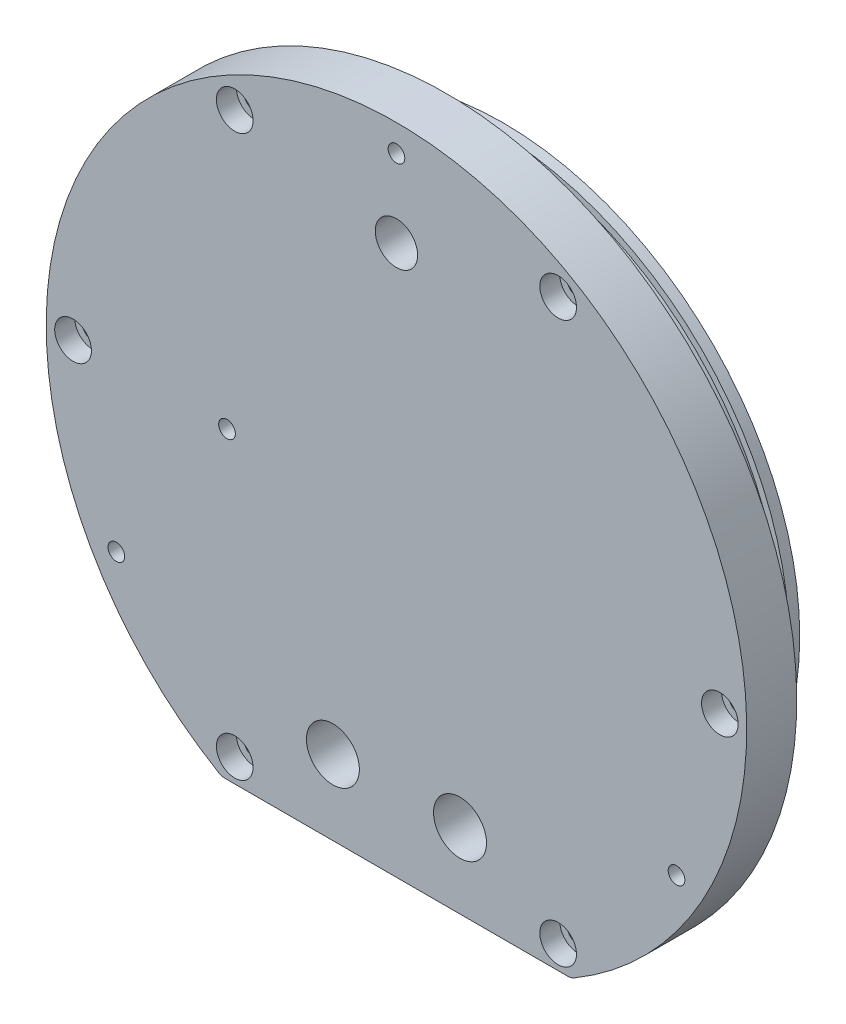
ISO-10303-21;
HEADER;
FILE_DESCRIPTION(('STEP AP214'),'2;1');
FILE_NAME('part.step','',(''),(''),'','','');
FILE_SCHEMA(('AUTOMOTIVE_DESIGN { 1 0 10303 214 1 1 1 1 }'));
ENDSEC;
DATA;
#1=APPLICATION_CONTEXT('core data for automotive mechanical design processes');
#2=APPLICATION_PROTOCOL_DEFINITION('international standard','automotive_design',2000,#1);
#3=PRODUCT_CONTEXT('',#1,'mechanical');
#4=PRODUCT('Part','Part','',(#3));
#5=PRODUCT_RELATED_PRODUCT_CATEGORY('part','',(#4));
#6=PRODUCT_DEFINITION_FORMATION('','',#4);
#7=PRODUCT_DEFINITION_CONTEXT('part definition',#1,'design');
#8=PRODUCT_DEFINITION('design','',#6,#7);
#9=PRODUCT_DEFINITION_SHAPE('','',#8);
#10=(LENGTH_UNIT() NAMED_UNIT(*) SI_UNIT(.MILLI.,.METRE.));
#11=(NAMED_UNIT(*) PLANE_ANGLE_UNIT() SI_UNIT($,.RADIAN.));
#12=(NAMED_UNIT(*) SI_UNIT($,.STERADIAN.) SOLID_ANGLE_UNIT());
#13=UNCERTAINTY_MEASURE_WITH_UNIT(LENGTH_MEASURE(1.E-05),#10,'distance_accuracy_value','');
#14=(GEOMETRIC_REPRESENTATION_CONTEXT(3) GLOBAL_UNCERTAINTY_ASSIGNED_CONTEXT((#13)) GLOBAL_UNIT_ASSIGNED_CONTEXT((#10,
#11,#12)) REPRESENTATION_CONTEXT('',''));
#15=CARTESIAN_POINT('',(0.,0.,0.));
#16=DIRECTION('',(0.,0.,1.));
#17=DIRECTION('',(1.,0.,0.));
#18=AXIS2_PLACEMENT_3D('',#15,#16,#17);
#19=CARTESIAN_POINT('',(-65.8067836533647,45.3626483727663,17.0000000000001));
#20=DIRECTION('',(0.,0.,-1.));
#21=DIRECTION('',(-1.,0.,0.));
#22=AXIS2_PLACEMENT_3D('',#19,#20,#21);
#23=CYLINDRICAL_SURFACE('',#22,88.9);
#24=CARTESIAN_POINT('',(-65.8067836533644,45.3626483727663,6.56000000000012));
#25=DIRECTION('',(0.,0.,-1.));
#26=DIRECTION('',(-1.,0.,0.));
#27=AXIS2_PLACEMENT_3D('',#24,#25,#26);
#28=CIRCLE('',#27,88.9);
#29=CARTESIAN_POINT('',(-154.706783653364,45.3626483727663,6.56000000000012));
#30=VERTEX_POINT('',#29);
#31=EDGE_CURVE('E371',#30,#30,#28,.T.);
#32=ORIENTED_EDGE('',*,*,#31,.F.);
#33=EDGE_LOOP('',(#32));
#34=FACE_BOUND('',#33,.T.);
#35=CARTESIAN_POINT('',(-65.8067836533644,45.3626483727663,9.80000000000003));
#36=DIRECTION('',(0.,0.,-1.));
#37=DIRECTION('',(-1.,0.,0.));
#38=AXIS2_PLACEMENT_3D('',#35,#36,#37);
#39=CIRCLE('',#38,88.9);
#40=CARTESIAN_POINT('',(-154.706783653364,45.3626483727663,9.80000000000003));
#41=VERTEX_POINT('',#40);
#42=EDGE_CURVE('E27',#41,#41,#39,.F.);
#43=ORIENTED_EDGE('',*,*,#42,.F.);
#44=EDGE_LOOP('',(#43));
#45=FACE_BOUND('',#44,.T.);
#46=ADVANCED_FACE('F24',(#34,#45),#23,.T.);
#47=CARTESIAN_POINT('',(-65.8067836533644,134.262648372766,9.80000000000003));
#48=DIRECTION('',(0.,0.,1.));
#49=DIRECTION('',(1.,0.,0.));
#50=AXIS2_PLACEMENT_3D('',#47,#48,#49);
#51=PLANE('',#50);
#52=CARTESIAN_POINT('',(-65.8067836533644,45.3626483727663,9.80000000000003));
#53=DIRECTION('',(0.,0.,1.));
#54=DIRECTION('',(1.,0.,0.));
#55=AXIS2_PLACEMENT_3D('',#52,#53,#54);
#56=CIRCLE('',#55,86.9);
#57=CARTESIAN_POINT('',(21.0932163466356,45.3626483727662,9.80000000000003));
#58=VERTEX_POINT('',#57);
#59=EDGE_CURVE('E146',#58,#58,#56,.T.);
#60=ORIENTED_EDGE('',*,*,#59,.F.);
#61=EDGE_LOOP('',(#60));
#62=FACE_BOUND('',#61,.T.);
#63=ORIENTED_EDGE('',*,*,#42,.T.);
#64=EDGE_LOOP('',(#63));
#65=FACE_BOUND('',#64,.T.);
#66=ADVANCED_FACE('F378',(#62,#65),#51,.T.);
#67=CARTESIAN_POINT('',(-65.8067836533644,134.262648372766,6.56000000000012));
#68=DIRECTION('',(0.,0.,-1.));
#69=DIRECTION('',(-1.,0.,0.));
#70=AXIS2_PLACEMENT_3D('',#67,#68,#69);
#71=PLANE('',#70);
#72=ORIENTED_EDGE('',*,*,#31,.T.);
#73=EDGE_LOOP('',(#72));
#74=FACE_BOUND('',#73,.T.);
#75=CARTESIAN_POINT('',(-65.8067836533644,45.3626483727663,6.56000000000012));
#76=DIRECTION('',(0.,0.,1.));
#77=DIRECTION('',(1.,0.,0.));
#78=AXIS2_PLACEMENT_3D('',#75,#76,#77);
#79=CIRCLE('',#78,86.9);
#80=CARTESIAN_POINT('',(21.0932163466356,45.3626483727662,6.56000000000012));
#81=VERTEX_POINT('',#80);
#82=EDGE_CURVE('E140',#81,#81,#79,.F.);
#83=ORIENTED_EDGE('',*,*,#82,.F.);
#84=EDGE_LOOP('',(#83));
#85=FACE_BOUND('',#84,.T.);
#86=ADVANCED_FACE('F133',(#74,#85),#71,.T.);
#87=CARTESIAN_POINT('',(-102.806783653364,-20.6373508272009,22.9999999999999));
#88=DIRECTION('',(0.,-1.00000000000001,0.));
#89=DIRECTION('',(0.,0.,-1.));
#90=AXIS2_PLACEMENT_3D('',#87,#88,#89);
#91=CONICAL_SURFACE('',#90,3.39999999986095,1.02974425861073);
#92=CARTESIAN_POINT('',(-102.806783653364,-18.5944247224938,22.9999999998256));
#93=VERTEX_POINT('',#92);
#94=VERTEX_LOOP('',#93);
#95=FACE_BOUND('',#94,.T.);
#96=CARTESIAN_POINT('',(-102.806783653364,-20.6373508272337,22.9999999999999));
#97=DIRECTION('',(0.,-1.00000000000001,0.));
#98=DIRECTION('',(0.,0.,-1.));
#99=AXIS2_PLACEMENT_3D('',#96,#97,#98);
#100=CIRCLE('',#99,3.4);
#101=CARTESIAN_POINT('',(-102.806783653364,-20.6373508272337,19.5999999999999));
#102=VERTEX_POINT('',#101);
#103=EDGE_CURVE('E137',#102,#102,#100,.T.);
#104=ORIENTED_EDGE('',*,*,#103,.T.);
#105=EDGE_LOOP('',(#104));
#106=FACE_BOUND('',#105,.T.);
#107=ADVANCED_FACE('F129',(#95,#106),#91,.F.);
#108=CARTESIAN_POINT('',(-28.8067836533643,-20.637350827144,22.9999999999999));
#109=DIRECTION('',(0.,-1.00000000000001,0.));
#110=DIRECTION('',(0.,0.,-1.));
#111=AXIS2_PLACEMENT_3D('',#108,#109,#110);
#112=CONICAL_SURFACE('',#111,3.39999999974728,1.02974425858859);
#113=CARTESIAN_POINT('',(-28.8067836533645,-18.594424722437,23.0000000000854));
#114=VERTEX_POINT('',#113);
#115=VERTEX_LOOP('',#114);
#116=FACE_BOUND('',#115,.T.);
#117=CARTESIAN_POINT('',(-28.8067836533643,-20.6373508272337,22.9999999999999));
#118=DIRECTION('',(0.,-1.00000000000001,0.));
#119=DIRECTION('',(0.,0.,-1.));
#120=AXIS2_PLACEMENT_3D('',#117,#118,#119);
#121=CIRCLE('',#120,3.4);
#122=CARTESIAN_POINT('',(-28.8067836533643,-20.6373508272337,19.5999999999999));
#123=VERTEX_POINT('',#122);
#124=EDGE_CURVE('E139',#123,#123,#121,.T.);
#125=ORIENTED_EDGE('',*,*,#124,.T.);
#126=EDGE_LOOP('',(#125));
#127=FACE_BOUND('',#126,.T.);
#128=ADVANCED_FACE('F132',(#116,#127),#112,.F.);
#129=CARTESIAN_POINT('',(-65.8067836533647,45.3626483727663,17.0000000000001));
#130=DIRECTION('',(0.,0.,1.));
#131=DIRECTION('',(1.,0.,0.));
#132=AXIS2_PLACEMENT_3D('',#129,#130,#131);
#133=CYLINDRICAL_SURFACE('',#132,86.9);
#134=ORIENTED_EDGE('',*,*,#59,.T.);
#135=EDGE_LOOP('',(#134));
#136=FACE_BOUND('',#135,.T.);
#137=CARTESIAN_POINT('',(-65.8067836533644,45.3626483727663,13.4000000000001));
#138=DIRECTION('',(0.,0.,1.));
#139=DIRECTION('',(1.,0.,0.));
#140=AXIS2_PLACEMENT_3D('',#137,#138,#139);
#141=CIRCLE('',#140,86.9);
#142=CARTESIAN_POINT('',(21.0932163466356,45.3626483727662,13.4000000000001));
#143=VERTEX_POINT('',#142);
#144=EDGE_CURVE('E143',#143,#143,#141,.T.);
#145=ORIENTED_EDGE('',*,*,#144,.F.);
#146=EDGE_LOOP('',(#145));
#147=FACE_BOUND('',#146,.T.);
#148=ADVANCED_FACE('F707',(#136,#147),#133,.T.);
#149=CARTESIAN_POINT('',(-65.8067836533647,45.3626483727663,17.0000000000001));
#150=DIRECTION('',(0.,0.,1.));
#151=DIRECTION('',(1.,0.,0.));
#152=AXIS2_PLACEMENT_3D('',#149,#150,#151);
#153=CYLINDRICAL_SURFACE('',#152,86.9);
#154=CARTESIAN_POINT('',(-65.8067836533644,45.3626483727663,3.20000000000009));
#155=DIRECTION('',(0.,0.,1.));
#156=DIRECTION('',(1.,0.,0.));
#157=AXIS2_PLACEMENT_3D('',#154,#155,#156);
#158=CIRCLE('',#157,86.9);
#159=CARTESIAN_POINT('',(21.0932163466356,45.3626483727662,3.20000000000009));
#160=VERTEX_POINT('',#159);
#161=EDGE_CURVE('E365',#160,#160,#158,.F.);
#162=ORIENTED_EDGE('',*,*,#161,.F.);
#163=EDGE_LOOP('',(#162));
#164=FACE_BOUND('',#163,.T.);
#165=ORIENTED_EDGE('',*,*,#82,.T.);
#166=EDGE_LOOP('',(#165));
#167=FACE_BOUND('',#166,.T.);
#168=ADVANCED_FACE('F704',(#164,#167),#153,.T.);
#169=CARTESIAN_POINT('',(-102.806783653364,-45.6373516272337,22.9999999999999));
#170=DIRECTION('',(0.,-1.00000000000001,0.));
#171=DIRECTION('',(0.,0.,-1.));
#172=AXIS2_PLACEMENT_3D('',#169,#170,#171);
#173=CYLINDRICAL_SURFACE('',#172,3.4);
#174=ORIENTED_EDGE('',*,*,#103,.F.);
#175=EDGE_LOOP('',(#174));
#176=FACE_BOUND('',#175,.T.);
#177=CARTESIAN_POINT('',(-102.806783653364,-25.6373408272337,22.9999999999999));
#178=DIRECTION('',(0.,-1.00000000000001,0.));
#179=DIRECTION('',(0.,0.,-1.));
#180=AXIS2_PLACEMENT_3D('',#177,#178,#179);
#181=CIRCLE('',#180,3.4);
#182=CARTESIAN_POINT('',(-102.806783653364,-25.6373408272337,19.5999999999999));
#183=VERTEX_POINT('',#182);
#184=EDGE_CURVE('E362',#183,#183,#181,.T.);
#185=ORIENTED_EDGE('',*,*,#184,.T.);
#186=EDGE_LOOP('',(#185));
#187=FACE_BOUND('',#186,.T.);
#188=ADVANCED_FACE('F700',(#176,#187),#173,.F.);
#189=CARTESIAN_POINT('',(-28.8067836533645,-45.6373516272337,22.9999999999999));
#190=DIRECTION('',(0.,-1.00000000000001,0.));
#191=DIRECTION('',(0.,0.,-1.));
#192=AXIS2_PLACEMENT_3D('',#189,#190,#191);
#193=CYLINDRICAL_SURFACE('',#192,3.4);
#194=ORIENTED_EDGE('',*,*,#124,.F.);
#195=EDGE_LOOP('',(#194));
#196=FACE_BOUND('',#195,.T.);
#197=CARTESIAN_POINT('',(-28.8067836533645,-25.6373408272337,22.9999999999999));
#198=DIRECTION('',(0.,-1.00000000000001,0.));
#199=DIRECTION('',(0.,0.,-1.));
#200=AXIS2_PLACEMENT_3D('',#197,#198,#199);
#201=CIRCLE('',#200,3.4);
#202=CARTESIAN_POINT('',(-28.8067836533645,-25.6373408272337,19.5999999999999));
#203=VERTEX_POINT('',#202);
#204=EDGE_CURVE('E359',#203,#203,#201,.T.);
#205=ORIENTED_EDGE('',*,*,#204,.T.);
#206=EDGE_LOOP('',(#205));
#207=FACE_BOUND('',#206,.T.);
#208=ADVANCED_FACE('F696',(#196,#207),#193,.F.);
#209=CARTESIAN_POINT('',(-65.8067836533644,134.262648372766,13.4000000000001));
#210=DIRECTION('',(0.,0.,-1.));
#211=DIRECTION('',(-1.,0.,0.));
#212=AXIS2_PLACEMENT_3D('',#209,#210,#211);
#213=PLANE('',#212);
#214=CARTESIAN_POINT('',(-65.8067836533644,45.3626483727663,13.4000000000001));
#215=DIRECTION('',(0.,0.,-1.));
#216=DIRECTION('',(-1.,0.,0.));
#217=AXIS2_PLACEMENT_3D('',#214,#215,#216);
#218=CIRCLE('',#217,88.9);
#219=CARTESIAN_POINT('',(-154.706783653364,45.3626483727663,13.4000000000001));
#220=VERTEX_POINT('',#219);
#221=EDGE_CURVE('E355',#220,#220,#218,.F.);
#222=ORIENTED_EDGE('',*,*,#221,.F.);
#223=EDGE_LOOP('',(#222));
#224=FACE_BOUND('',#223,.T.);
#225=ORIENTED_EDGE('',*,*,#144,.T.);
#226=EDGE_LOOP('',(#225));
#227=FACE_BOUND('',#226,.T.);
#228=ADVANCED_FACE('F692',(#224,#227),#213,.T.);
#229=CARTESIAN_POINT('',(-27.7067836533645,82.2688483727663,5.7404000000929));
#230=DIRECTION('',(0.,0.,-1.));
#231=DIRECTION('',(-1.,0.,0.));
#232=AXIS2_PLACEMENT_3D('',#229,#230,#231);
#233=CONICAL_SURFACE('',#232,0.888999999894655,1.02974425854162);
#234=CARTESIAN_POINT('',(-27.7067836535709,82.2688483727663,6.27456509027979));
#235=VERTEX_POINT('',#234);
#236=VERTEX_LOOP('',#235);
#237=FACE_BOUND('',#236,.T.);
#238=CARTESIAN_POINT('',(-27.7067836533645,82.2688483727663,5.74040000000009));
#239=DIRECTION('',(0.,0.,-1.));
#240=DIRECTION('',(-1.,0.,0.));
#241=AXIS2_PLACEMENT_3D('',#238,#239,#240);
#242=CIRCLE('',#241,0.889);
#243=CARTESIAN_POINT('',(-28.5957836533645,82.2688483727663,5.74040000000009));
#244=VERTEX_POINT('',#243);
#245=EDGE_CURVE('E358',#244,#244,#242,.T.);
#246=ORIENTED_EDGE('',*,*,#245,.T.);
#247=EDGE_LOOP('',(#246));
#248=FACE_BOUND('',#247,.T.);
#249=ADVANCED_FACE('F688',(#237,#248),#233,.F.);
#250=CARTESIAN_POINT('',(-27.7067836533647,34.0596483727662,5.7404000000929));
#251=DIRECTION('',(0.,0.,-1.));
#252=DIRECTION('',(-1.,0.,0.));
#253=AXIS2_PLACEMENT_3D('',#250,#251,#252);
#254=CONICAL_SURFACE('',#253,0.888999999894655,1.02974425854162);
#255=CARTESIAN_POINT('',(-27.7067836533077,34.0596483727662,6.27456509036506));
#256=VERTEX_POINT('',#255);
#257=VERTEX_LOOP('',#256);
#258=FACE_BOUND('',#257,.T.);
#259=CARTESIAN_POINT('',(-27.7067836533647,34.0596483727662,5.74040000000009));
#260=DIRECTION('',(0.,0.,-1.));
#261=DIRECTION('',(-1.,0.,0.));
#262=AXIS2_PLACEMENT_3D('',#259,#260,#261);
#263=CIRCLE('',#262,0.889);
#264=CARTESIAN_POINT('',(-28.5957836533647,34.0596483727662,5.74040000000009));
#265=VERTEX_POINT('',#264);
#266=EDGE_CURVE('E1115',#265,#265,#263,.T.);
#267=ORIENTED_EDGE('',*,*,#266,.T.);
#268=EDGE_LOOP('',(#267));
#269=FACE_BOUND('',#268,.T.);
#270=ADVANCED_FACE('F684',(#258,#269),#254,.F.);
#271=CARTESIAN_POINT('',(-91.5877836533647,-2.36395162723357,5.74039999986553));
#272=DIRECTION('',(0.,0.,-1.));
#273=DIRECTION('',(-1.,0.,0.));
#274=AXIS2_PLACEMENT_3D('',#271,#272,#273);
#275=CONICAL_SURFACE('',#274,0.889000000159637,1.02974425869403);
#276=CARTESIAN_POINT('',(-91.5877836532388,-2.36395162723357,6.27456509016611));
#277=VERTEX_POINT('',#276);
#278=VERTEX_LOOP('',#277);
#279=FACE_BOUND('',#278,.T.);
#280=CARTESIAN_POINT('',(-91.5877836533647,-2.36395162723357,5.74040000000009));
#281=DIRECTION('',(0.,0.,-1.));
#282=DIRECTION('',(-1.,0.,0.));
#283=AXIS2_PLACEMENT_3D('',#280,#281,#282);
#284=CIRCLE('',#283,0.889);
#285=CARTESIAN_POINT('',(-92.4767836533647,-2.36395162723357,5.74040000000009));
#286=VERTEX_POINT('',#285);
#287=EDGE_CURVE('E1117',#286,#286,#284,.T.);
#288=ORIENTED_EDGE('',*,*,#287,.T.);
#289=EDGE_LOOP('',(#288));
#290=FACE_BOUND('',#289,.T.);
#291=ADVANCED_FACE('F680',(#279,#290),#275,.F.);
#292=CARTESIAN_POINT('',(-91.5877836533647,31.9260483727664,5.74039999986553));
#293=DIRECTION('',(0.,0.,-1.));
#294=DIRECTION('',(-1.,0.,0.));
#295=AXIS2_PLACEMENT_3D('',#292,#293,#294);
#296=CONICAL_SURFACE('',#295,0.889000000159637,1.02974425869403);
#297=CARTESIAN_POINT('',(-91.5877836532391,31.9260483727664,6.27456509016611));
#298=VERTEX_POINT('',#297);
#299=VERTEX_LOOP('',#298);
#300=FACE_BOUND('',#299,.T.);
#301=CARTESIAN_POINT('',(-91.5877836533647,31.9260483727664,5.74040000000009));
#302=DIRECTION('',(0.,0.,-1.));
#303=DIRECTION('',(-1.,0.,0.));
#304=AXIS2_PLACEMENT_3D('',#301,#302,#303);
#305=CIRCLE('',#304,0.889);
#306=CARTESIAN_POINT('',(-92.4767836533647,31.9260483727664,5.74040000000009));
#307=VERTEX_POINT('',#306);
#308=EDGE_CURVE('E1122',#307,#307,#305,.T.);
#309=ORIENTED_EDGE('',*,*,#308,.T.);
#310=EDGE_LOOP('',(#309));
#311=FACE_BOUND('',#310,.T.);
#312=ADVANCED_FACE('F676',(#300,#311),#296,.F.);
#313=CARTESIAN_POINT('',(-11.1967836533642,0.63324837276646,16.5099999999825));
#314=DIRECTION('',(0.,0.,-1.));
#315=DIRECTION('',(-1.,0.,0.));
#316=AXIS2_PLACEMENT_3D('',#313,#314,#315);
#317=CONICAL_SURFACE('',#316,2.55269999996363,1.02974425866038);
#318=CARTESIAN_POINT('',(-11.1967836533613,0.63324837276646,18.04381690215));
#319=VERTEX_POINT('',#318);
#320=VERTEX_LOOP('',#319);
#321=FACE_BOUND('',#320,.T.);
#322=CARTESIAN_POINT('',(-11.1967836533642,0.63324837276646,16.51));
#323=DIRECTION('',(0.,0.,-1.));
#324=DIRECTION('',(-1.,0.,0.));
#325=AXIS2_PLACEMENT_3D('',#322,#323,#324);
#326=CIRCLE('',#325,2.5527);
#327=CARTESIAN_POINT('',(-13.7494836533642,0.633248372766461,16.51));
#328=VERTEX_POINT('',#327);
#329=EDGE_CURVE('E1125',#328,#328,#326,.T.);
#330=ORIENTED_EDGE('',*,*,#329,.T.);
#331=EDGE_LOOP('',(#330));
#332=FACE_BOUND('',#331,.T.);
#333=ADVANCED_FACE('F672',(#321,#332),#317,.F.);
#334=CARTESIAN_POINT('',(-11.1967836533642,101.039448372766,16.5099999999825));
#335=DIRECTION('',(0.,0.,-1.));
#336=DIRECTION('',(-1.,0.,0.));
#337=AXIS2_PLACEMENT_3D('',#334,#335,#336);
#338=CONICAL_SURFACE('',#337,2.55269999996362,1.02974425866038);
#339=CARTESIAN_POINT('',(-11.1967836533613,101.039448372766,18.04381690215));
#340=VERTEX_POINT('',#339);
#341=VERTEX_LOOP('',#340);
#342=FACE_BOUND('',#341,.T.);
#343=CARTESIAN_POINT('',(-11.1967836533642,101.039448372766,16.51));
#344=DIRECTION('',(0.,0.,-1.));
#345=DIRECTION('',(-1.,0.,0.));
#346=AXIS2_PLACEMENT_3D('',#343,#344,#345);
#347=CIRCLE('',#346,2.5527);
#348=CARTESIAN_POINT('',(-13.7494836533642,101.039448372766,16.51));
#349=VERTEX_POINT('',#348);
#350=EDGE_CURVE('E1128',#349,#349,#347,.T.);
#351=ORIENTED_EDGE('',*,*,#350,.T.);
#352=EDGE_LOOP('',(#351));
#353=FACE_BOUND('',#352,.T.);
#354=ADVANCED_FACE('F668',(#342,#353),#338,.F.);
#355=CARTESIAN_POINT('',(-120.416783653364,101.039448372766,16.5099999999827));
#356=DIRECTION('',(0.,0.,-1.));
#357=DIRECTION('',(-1.,0.,0.));
#358=AXIS2_PLACEMENT_3D('',#355,#356,#357);
#359=CONICAL_SURFACE('',#358,2.55269999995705,1.02974425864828);
#360=CARTESIAN_POINT('',(-120.416783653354,101.039448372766,18.0438169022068));
#361=VERTEX_POINT('',#360);
#362=VERTEX_LOOP('',#361);
#363=FACE_BOUND('',#362,.T.);
#364=CARTESIAN_POINT('',(-120.416783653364,101.039448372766,16.51));
#365=DIRECTION('',(0.,0.,-1.));
#366=DIRECTION('',(-1.,0.,0.));
#367=AXIS2_PLACEMENT_3D('',#364,#365,#366);
#368=CIRCLE('',#367,2.5527);
#369=CARTESIAN_POINT('',(-122.969483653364,101.039448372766,16.51));
#370=VERTEX_POINT('',#369);
#371=EDGE_CURVE('E1131',#370,#370,#368,.T.);
#372=ORIENTED_EDGE('',*,*,#371,.T.);
#373=EDGE_LOOP('',(#372));
#374=FACE_BOUND('',#373,.T.);
#375=ADVANCED_FACE('F664',(#363,#374),#359,.F.);
#376=CARTESIAN_POINT('',(-120.416783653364,0.63324837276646,16.5099999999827));
#377=DIRECTION('',(0.,0.,-1.));
#378=DIRECTION('',(-1.,0.,0.));
#379=AXIS2_PLACEMENT_3D('',#376,#377,#378);
#380=CONICAL_SURFACE('',#379,2.55269999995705,1.02974425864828);
#381=CARTESIAN_POINT('',(-120.416783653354,0.63324837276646,18.0438169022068));
#382=VERTEX_POINT('',#381);
#383=VERTEX_LOOP('',#382);
#384=FACE_BOUND('',#383,.T.);
#385=CARTESIAN_POINT('',(-120.416783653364,0.63324837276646,16.51));
#386=DIRECTION('',(0.,0.,-1.));
#387=DIRECTION('',(-1.,0.,0.));
#388=AXIS2_PLACEMENT_3D('',#385,#386,#387);
#389=CIRCLE('',#388,2.5527);
#390=CARTESIAN_POINT('',(-122.969483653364,0.633248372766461,16.51));
#391=VERTEX_POINT('',#390);
#392=EDGE_CURVE('E354',#391,#391,#389,.T.);
#393=ORIENTED_EDGE('',*,*,#392,.T.);
#394=EDGE_LOOP('',(#393));
#395=FACE_BOUND('',#394,.T.);
#396=ADVANCED_FACE('F660',(#384,#395),#380,.F.);
#397=CARTESIAN_POINT('',(-65.8067836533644,134.262648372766,3.20000000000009));
#398=DIRECTION('',(0.,0.,1.));
#399=DIRECTION('',(1.,0.,0.));
#400=AXIS2_PLACEMENT_3D('',#397,#398,#399);
#401=PLANE('',#400);
#402=ORIENTED_EDGE('',*,*,#161,.T.);
#403=EDGE_LOOP('',(#402));
#404=FACE_BOUND('',#403,.T.);
#405=CARTESIAN_POINT('',(-65.8067836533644,45.3626483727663,3.20000000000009));
#406=DIRECTION('',(0.,0.,-1.));
#407=DIRECTION('',(-1.,0.,0.));
#408=AXIS2_PLACEMENT_3D('',#405,#406,#407);
#409=CIRCLE('',#408,88.9);
#410=CARTESIAN_POINT('',(-154.706783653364,45.3626483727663,3.20000000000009));
#411=VERTEX_POINT('',#410);
#412=EDGE_CURVE('E350',#411,#411,#409,.T.);
#413=ORIENTED_EDGE('',*,*,#412,.F.);
#414=EDGE_LOOP('',(#413));
#415=FACE_BOUND('',#414,.T.);
#416=ADVANCED_FACE('F656',(#404,#415),#401,.T.);
#417=CARTESIAN_POINT('',(-26.4367836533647,-8.58695162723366,10.7949999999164));
#418=DIRECTION('',(0.,0.,-1.));
#419=DIRECTION('',(-1.,0.,0.));
#420=AXIS2_PLACEMENT_3D('',#417,#418,#419);
#421=CONICAL_SURFACE('',#420,1.13030000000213,1.02974425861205);
#422=CARTESIAN_POINT('',(-26.4367836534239,-8.58695162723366,11.4741527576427));
#423=VERTEX_POINT('',#422);
#424=VERTEX_LOOP('',#423);
#425=FACE_BOUND('',#424,.T.);
#426=CARTESIAN_POINT('',(-26.4367836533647,-8.58695162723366,10.7949999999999));
#427=DIRECTION('',(0.,0.,-1.));
#428=DIRECTION('',(-1.,0.,0.));
#429=AXIS2_PLACEMENT_3D('',#426,#427,#428);
#430=CIRCLE('',#429,1.1303);
#431=CARTESIAN_POINT('',(-27.5670836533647,-8.58695162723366,10.7949999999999));
#432=VERTEX_POINT('',#431);
#433=EDGE_CURVE('E353',#432,#432,#430,.T.);
#434=ORIENTED_EDGE('',*,*,#433,.T.);
#435=EDGE_LOOP('',(#434));
#436=FACE_BOUND('',#435,.T.);
#437=ADVANCED_FACE('F652',(#425,#436),#421,.F.);
#438=CARTESIAN_POINT('',(-26.4367836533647,99.3122483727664,10.7949999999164));
#439=DIRECTION('',(0.,0.,-1.));
#440=DIRECTION('',(-1.,0.,0.));
#441=AXIS2_PLACEMENT_3D('',#438,#439,#440);
#442=CONICAL_SURFACE('',#441,1.13030000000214,1.02974425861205);
#443=CARTESIAN_POINT('',(-26.4367836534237,99.3122483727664,11.4741527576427));
#444=VERTEX_POINT('',#443);
#445=VERTEX_LOOP('',#444);
#446=FACE_BOUND('',#445,.T.);
#447=CARTESIAN_POINT('',(-26.4367836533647,99.3122483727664,10.7950000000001));
#448=DIRECTION('',(0.,0.,-1.));
#449=DIRECTION('',(-1.,0.,0.));
#450=AXIS2_PLACEMENT_3D('',#447,#448,#449);
#451=CIRCLE('',#450,1.1303);
#452=CARTESIAN_POINT('',(-27.5670836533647,99.3122483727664,10.7950000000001));
#453=VERTEX_POINT('',#452);
#454=EDGE_CURVE('E1138',#453,#453,#451,.T.);
#455=ORIENTED_EDGE('',*,*,#454,.T.);
#456=EDGE_LOOP('',(#455));
#457=FACE_BOUND('',#456,.T.);
#458=ADVANCED_FACE('F648',(#446,#457),#442,.F.);
#459=CARTESIAN_POINT('',(-105.176783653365,99.3122483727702,10.7949999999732));
#460=DIRECTION('',(0.,0.,-1.));
#461=DIRECTION('',(-1.,0.,0.));
#462=AXIS2_PLACEMENT_3D('',#459,#460,#461);
#463=CONICAL_SURFACE('',#462,1.13030000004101,1.02974425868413);
#464=CARTESIAN_POINT('',(-105.176783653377,99.3122483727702,11.4741527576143));
#465=VERTEX_POINT('',#464);
#466=VERTEX_LOOP('',#465);
#467=FACE_BOUND('',#466,.T.);
#468=CARTESIAN_POINT('',(-105.176783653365,99.3122483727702,10.7949999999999));
#469=DIRECTION('',(0.,0.,-1.));
#470=DIRECTION('',(-1.,0.,0.));
#471=AXIS2_PLACEMENT_3D('',#468,#469,#470);
#472=CIRCLE('',#471,1.1303);
#473=CARTESIAN_POINT('',(-106.307083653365,99.3122483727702,10.7949999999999));
#474=VERTEX_POINT('',#473);
#475=EDGE_CURVE('E1141',#474,#474,#472,.T.);
#476=ORIENTED_EDGE('',*,*,#475,.T.);
#477=EDGE_LOOP('',(#476));
#478=FACE_BOUND('',#477,.T.);
#479=ADVANCED_FACE('F644',(#467,#478),#463,.F.);
#480=CARTESIAN_POINT('',(-105.176783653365,-8.58695162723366,10.7949999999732));
#481=DIRECTION('',(0.,0.,-1.));
#482=DIRECTION('',(-1.,0.,0.));
#483=AXIS2_PLACEMENT_3D('',#480,#481,#482);
#484=CONICAL_SURFACE('',#483,1.13030000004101,1.02974425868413);
#485=CARTESIAN_POINT('',(-105.176783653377,-8.58695162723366,11.4741527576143));
#486=VERTEX_POINT('',#485);
#487=VERTEX_LOOP('',#486);
#488=FACE_BOUND('',#487,.T.);
#489=CARTESIAN_POINT('',(-105.176783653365,-8.58695162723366,10.7949999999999));
#490=DIRECTION('',(0.,0.,-1.));
#491=DIRECTION('',(-1.,0.,0.));
#492=AXIS2_PLACEMENT_3D('',#489,#490,#491);
#493=CIRCLE('',#492,1.1303);
#494=CARTESIAN_POINT('',(-106.307083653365,-8.58695162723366,10.7949999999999));
#495=VERTEX_POINT('',#494);
#496=EDGE_CURVE('E1144',#495,#495,#493,.T.);
#497=ORIENTED_EDGE('',*,*,#496,.T.);
#498=EDGE_LOOP('',(#497));
#499=FACE_BOUND('',#498,.T.);
#500=ADVANCED_FACE('F640',(#488,#499),#484,.F.);
#501=CARTESIAN_POINT('',(-120.416783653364,67.9813483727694,16.5099999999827));
#502=DIRECTION('',(0.,0.,-1.));
#503=DIRECTION('',(-1.,0.,0.));
#504=AXIS2_PLACEMENT_3D('',#501,#502,#503);
#505=CONICAL_SURFACE('',#504,2.55269999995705,1.02974425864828);
#506=CARTESIAN_POINT('',(-120.416783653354,67.9813483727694,18.0438169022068));
#507=VERTEX_POINT('',#506);
#508=VERTEX_LOOP('',#507);
#509=FACE_BOUND('',#508,.T.);
#510=CARTESIAN_POINT('',(-120.416783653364,67.9813483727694,16.51));
#511=DIRECTION('',(0.,0.,-1.));
#512=DIRECTION('',(-1.,0.,0.));
#513=AXIS2_PLACEMENT_3D('',#510,#511,#512);
#514=CIRCLE('',#513,2.5527);
#515=CARTESIAN_POINT('',(-122.969483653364,67.9813483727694,16.51));
#516=VERTEX_POINT('',#515);
#517=EDGE_CURVE('E1147',#516,#516,#514,.T.);
#518=ORIENTED_EDGE('',*,*,#517,.T.);
#519=EDGE_LOOP('',(#518));
#520=FACE_BOUND('',#519,.T.);
#521=ADVANCED_FACE('F636',(#509,#520),#505,.F.);
#522=CARTESIAN_POINT('',(-120.416783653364,33.6913483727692,16.5099999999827));
#523=DIRECTION('',(0.,0.,-1.));
#524=DIRECTION('',(-1.,0.,0.));
#525=AXIS2_PLACEMENT_3D('',#522,#523,#524);
#526=CONICAL_SURFACE('',#525,2.55269999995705,1.02974425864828);
#527=CARTESIAN_POINT('',(-120.416783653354,33.6913483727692,18.0438169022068));
#528=VERTEX_POINT('',#527);
#529=VERTEX_LOOP('',#528);
#530=FACE_BOUND('',#529,.T.);
#531=CARTESIAN_POINT('',(-120.416783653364,33.6913483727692,16.51));
#532=DIRECTION('',(0.,0.,-1.));
#533=DIRECTION('',(-1.,0.,0.));
#534=AXIS2_PLACEMENT_3D('',#531,#532,#533);
#535=CIRCLE('',#534,2.5527);
#536=CARTESIAN_POINT('',(-122.969483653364,33.6913483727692,16.51));
#537=VERTEX_POINT('',#536);
#538=EDGE_CURVE('E1150',#537,#537,#535,.T.);
#539=ORIENTED_EDGE('',*,*,#538,.T.);
#540=EDGE_LOOP('',(#539));
#541=FACE_BOUND('',#540,.T.);
#542=ADVANCED_FACE('F632',(#530,#541),#526,.F.);
#543=CARTESIAN_POINT('',(-11.1967836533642,33.691348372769,16.5099999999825));
#544=DIRECTION('',(0.,0.,-1.));
#545=DIRECTION('',(-1.,0.,0.));
#546=AXIS2_PLACEMENT_3D('',#543,#544,#545);
#547=CONICAL_SURFACE('',#546,2.55269999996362,1.02974425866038);
#548=CARTESIAN_POINT('',(-11.1967836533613,33.691348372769,18.04381690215));
#549=VERTEX_POINT('',#548);
#550=VERTEX_LOOP('',#549);
#551=FACE_BOUND('',#550,.T.);
#552=CARTESIAN_POINT('',(-11.1967836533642,33.691348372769,16.51));
#553=DIRECTION('',(0.,0.,-1.));
#554=DIRECTION('',(-1.,0.,0.));
#555=AXIS2_PLACEMENT_3D('',#552,#553,#554);
#556=CIRCLE('',#555,2.5527);
#557=CARTESIAN_POINT('',(-13.7494836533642,33.691348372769,16.51));
#558=VERTEX_POINT('',#557);
#559=EDGE_CURVE('E1153',#558,#558,#556,.T.);
#560=ORIENTED_EDGE('',*,*,#559,.T.);
#561=EDGE_LOOP('',(#560));
#562=FACE_BOUND('',#561,.T.);
#563=ADVANCED_FACE('F628',(#551,#562),#547,.F.);
#564=CARTESIAN_POINT('',(-11.1967836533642,67.9813483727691,16.5099999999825));
#565=DIRECTION('',(0.,0.,-1.));
#566=DIRECTION('',(-1.,0.,0.));
#567=AXIS2_PLACEMENT_3D('',#564,#565,#566);
#568=CONICAL_SURFACE('',#567,2.55269999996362,1.02974425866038);
#569=CARTESIAN_POINT('',(-11.1967836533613,67.9813483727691,18.04381690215));
#570=VERTEX_POINT('',#569);
#571=VERTEX_LOOP('',#570);
#572=FACE_BOUND('',#571,.T.);
#573=CARTESIAN_POINT('',(-11.1967836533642,67.9813483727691,16.51));
#574=DIRECTION('',(0.,0.,-1.));
#575=DIRECTION('',(-1.,0.,0.));
#576=AXIS2_PLACEMENT_3D('',#573,#574,#575);
#577=CIRCLE('',#576,2.5527);
#578=CARTESIAN_POINT('',(-13.7494836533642,67.9813483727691,16.51));
#579=VERTEX_POINT('',#578);
#580=EDGE_CURVE('E1156',#579,#579,#577,.T.);
#581=ORIENTED_EDGE('',*,*,#580,.T.);
#582=EDGE_LOOP('',(#581));
#583=FACE_BOUND('',#582,.T.);
#584=ADVANCED_FACE('F624',(#572,#583),#568,.F.);
#585=CARTESIAN_POINT('',(-78.5067836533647,34.0596483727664,5.74039999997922));
#586=DIRECTION('',(0.,0.,-1.));
#587=DIRECTION('',(-1.,0.,0.));
#588=AXIS2_PLACEMENT_3D('',#585,#586,#587);
#589=CONICAL_SURFACE('',#588,0.889000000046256,1.02974425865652);
#590=CARTESIAN_POINT('',(-78.5067836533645,34.0596483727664,6.27456509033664));
#591=VERTEX_POINT('',#590);
#592=VERTEX_LOOP('',#591);
#593=FACE_BOUND('',#592,.T.);
#594=CARTESIAN_POINT('',(-78.5067836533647,34.0596483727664,5.74040000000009));
#595=DIRECTION('',(0.,0.,-1.));
#596=DIRECTION('',(-1.,0.,0.));
#597=AXIS2_PLACEMENT_3D('',#594,#595,#596);
#598=CIRCLE('',#597,0.889);
#599=CARTESIAN_POINT('',(-79.3957836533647,34.0596483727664,5.74040000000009));
#600=VERTEX_POINT('',#599);
#601=EDGE_CURVE('E1159',#600,#600,#598,.T.);
#602=ORIENTED_EDGE('',*,*,#601,.T.);
#603=EDGE_LOOP('',(#602));
#604=FACE_BOUND('',#603,.T.);
#605=ADVANCED_FACE('F620',(#593,#604),#589,.F.);
#606=CARTESIAN_POINT('',(-78.5067836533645,82.2688483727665,5.74039999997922));
#607=DIRECTION('',(0.,0.,-1.));
#608=DIRECTION('',(-1.,0.,0.));
#609=AXIS2_PLACEMENT_3D('',#606,#607,#608);
#610=CONICAL_SURFACE('',#609,0.889000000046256,1.02974425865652);
#611=CARTESIAN_POINT('',(-78.5067836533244,82.2688483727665,6.27456509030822));
#612=VERTEX_POINT('',#611);
#613=VERTEX_LOOP('',#612);
#614=FACE_BOUND('',#613,.T.);
#615=CARTESIAN_POINT('',(-78.5067836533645,82.2688483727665,5.74040000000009));
#616=DIRECTION('',(0.,0.,-1.));
#617=DIRECTION('',(-1.,0.,0.));
#618=AXIS2_PLACEMENT_3D('',#615,#616,#617);
#619=CIRCLE('',#618,0.889);
#620=CARTESIAN_POINT('',(-79.3957836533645,82.2688483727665,5.74040000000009));
#621=VERTEX_POINT('',#620);
#622=EDGE_CURVE('E349',#621,#621,#619,.T.);
#623=ORIENTED_EDGE('',*,*,#622,.T.);
#624=EDGE_LOOP('',(#623));
#625=FACE_BOUND('',#624,.T.);
#626=ADVANCED_FACE('F616',(#614,#625),#610,.F.);
#627=CARTESIAN_POINT('',(-99.4067836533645,-25.6373408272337,23.0000000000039));
#628=DIRECTION('',(0.,1.00000000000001,0.));
#629=DIRECTION('',(0.,0.,1.));
#630=AXIS2_PLACEMENT_3D('',#627,#628,#629);
#631=PLANE('',#630);
#632=CARTESIAN_POINT('',(-102.806783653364,-25.6373408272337,22.9999999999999));
#633=DIRECTION('',(0.,-1.00000000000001,0.));
#634=DIRECTION('',(0.,0.,-1.));
#635=AXIS2_PLACEMENT_3D('',#632,#633,#634);
#636=CIRCLE('',#635,4.);
#637=CARTESIAN_POINT('',(-102.806783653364,-25.6373408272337,18.9999999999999));
#638=VERTEX_POINT('',#637);
#639=EDGE_CURVE('E346',#638,#638,#636,.T.);
#640=ORIENTED_EDGE('',*,*,#639,.T.);
#641=EDGE_LOOP('',(#640));
#642=FACE_BOUND('',#641,.T.);
#643=ORIENTED_EDGE('',*,*,#184,.F.);
#644=EDGE_LOOP('',(#643));
#645=FACE_BOUND('',#644,.T.);
#646=ADVANCED_FACE('F612',(#642,#645),#631,.F.);
#647=CARTESIAN_POINT('',(-25.4067836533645,-25.6373408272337,22.9999999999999));
#648=DIRECTION('',(0.,1.00000000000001,0.));
#649=DIRECTION('',(0.,0.,1.));
#650=AXIS2_PLACEMENT_3D('',#647,#648,#649);
#651=PLANE('',#650);
#652=CARTESIAN_POINT('',(-28.8067836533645,-25.6373408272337,22.9999999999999));
#653=DIRECTION('',(0.,-1.00000000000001,0.));
#654=DIRECTION('',(0.,0.,-1.));
#655=AXIS2_PLACEMENT_3D('',#652,#653,#654);
#656=CIRCLE('',#655,4.);
#657=CARTESIAN_POINT('',(-28.8067836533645,-25.6373408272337,18.9999999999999));
#658=VERTEX_POINT('',#657);
#659=EDGE_CURVE('E343',#658,#658,#656,.T.);
#660=ORIENTED_EDGE('',*,*,#659,.T.);
#661=EDGE_LOOP('',(#660));
#662=FACE_BOUND('',#661,.T.);
#663=ORIENTED_EDGE('',*,*,#204,.F.);
#664=EDGE_LOOP('',(#663));
#665=FACE_BOUND('',#664,.T.);
#666=ADVANCED_FACE('F608',(#662,#665),#651,.F.);
#667=CARTESIAN_POINT('',(-65.8067836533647,45.3626483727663,17.0000000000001));
#668=DIRECTION('',(0.,0.,-1.));
#669=DIRECTION('',(-1.,0.,0.));
#670=AXIS2_PLACEMENT_3D('',#667,#668,#669);
#671=CYLINDRICAL_SURFACE('',#670,88.9);
#672=CARTESIAN_POINT('',(-65.8067836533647,45.3626483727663,17.0000000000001));
#673=DIRECTION('',(0.,0.,-1.));
#674=DIRECTION('',(-1.,0.,0.));
#675=AXIS2_PLACEMENT_3D('',#672,#673,#674);
#676=CIRCLE('',#675,88.9);
#677=CARTESIAN_POINT('',(-154.706783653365,45.3626483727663,17.0000000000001));
#678=VERTEX_POINT('',#677);
#679=EDGE_CURVE('E322',#678,#678,#676,.T.);
#680=ORIENTED_EDGE('',*,*,#679,.T.);
#681=EDGE_LOOP('',(#680));
#682=FACE_BOUND('',#681,.T.);
#683=ORIENTED_EDGE('',*,*,#221,.T.);
#684=EDGE_LOOP('',(#683));
#685=FACE_BOUND('',#684,.T.);
#686=ADVANCED_FACE('F604',(#682,#685),#671,.T.);
#687=CARTESIAN_POINT('',(-114.281783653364,129.323811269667,32.));
#688=DIRECTION('',(0.,0.,1.));
#689=DIRECTION('',(1.,0.,0.));
#690=AXIS2_PLACEMENT_3D('',#687,#688,#689);
#691=CYLINDRICAL_SURFACE('',#690,3.3);
#692=CARTESIAN_POINT('',(-114.281783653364,129.323811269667,17.0000000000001));
#693=DIRECTION('',(0.,0.,1.));
#694=DIRECTION('',(1.,0.,0.));
#695=AXIS2_PLACEMENT_3D('',#692,#693,#694);
#696=CIRCLE('',#695,3.3);
#697=CARTESIAN_POINT('',(-110.981783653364,129.323811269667,17.0000000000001));
#698=VERTEX_POINT('',#697);
#699=EDGE_CURVE('E340',#698,#698,#696,.F.);
#700=ORIENTED_EDGE('',*,*,#699,.T.);
#701=EDGE_LOOP('',(#700));
#702=FACE_BOUND('',#701,.T.);
#703=CARTESIAN_POINT('',(-114.281783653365,129.323811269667,26.));
#704=DIRECTION('',(0.,0.,1.));
#705=DIRECTION('',(1.,0.,0.));
#706=AXIS2_PLACEMENT_3D('',#703,#704,#705);
#707=CIRCLE('',#706,3.3);
#708=CARTESIAN_POINT('',(-110.981783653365,129.323811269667,26.));
#709=VERTEX_POINT('',#708);
#710=EDGE_CURVE('E319',#709,#709,#707,.T.);
#711=ORIENTED_EDGE('',*,*,#710,.T.);
#712=EDGE_LOOP('',(#711));
#713=FACE_BOUND('',#712,.T.);
#714=ADVANCED_FACE('F600',(#702,#713),#691,.F.);
#715=CARTESIAN_POINT('',(-17.3317836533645,129.323811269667,32.000000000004));
#716=DIRECTION('',(0.,0.,1.));
#717=DIRECTION('',(1.,0.,0.));
#718=AXIS2_PLACEMENT_3D('',#715,#716,#717);
#719=CYLINDRICAL_SURFACE('',#718,3.3);
#720=CARTESIAN_POINT('',(-17.3317836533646,129.323811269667,17.0000000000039));
#721=DIRECTION('',(0.,0.,1.));
#722=DIRECTION('',(1.,0.,0.));
#723=AXIS2_PLACEMENT_3D('',#720,#721,#722);
#724=CIRCLE('',#723,3.3);
#725=CARTESIAN_POINT('',(-14.0317836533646,129.323811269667,17.0000000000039));
#726=VERTEX_POINT('',#725);
#727=EDGE_CURVE('E337',#726,#726,#724,.F.);
#728=ORIENTED_EDGE('',*,*,#727,.T.);
#729=EDGE_LOOP('',(#728));
#730=FACE_BOUND('',#729,.T.);
#731=CARTESIAN_POINT('',(-17.3317836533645,129.323811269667,26.000000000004));
#732=DIRECTION('',(0.,0.,1.));
#733=DIRECTION('',(1.,0.,0.));
#734=AXIS2_PLACEMENT_3D('',#731,#732,#733);
#735=CIRCLE('',#734,3.3);
#736=CARTESIAN_POINT('',(-14.0317836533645,129.323811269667,26.000000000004));
#737=VERTEX_POINT('',#736);
#738=EDGE_CURVE('E316',#737,#737,#735,.T.);
#739=ORIENTED_EDGE('',*,*,#738,.T.);
#740=EDGE_LOOP('',(#739));
#741=FACE_BOUND('',#740,.T.);
#742=ADVANCED_FACE('F596',(#730,#741),#719,.F.);
#743=CARTESIAN_POINT('',(-17.3317836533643,-38.5985145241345,32.0000000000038));
#744=DIRECTION('',(0.,0.,1.));
#745=DIRECTION('',(1.,0.,0.));
#746=AXIS2_PLACEMENT_3D('',#743,#744,#745);
#747=CYLINDRICAL_SURFACE('',#746,3.3);
#748=CARTESIAN_POINT('',(-17.3317836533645,-38.5985145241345,17.0000000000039));
#749=DIRECTION('',(0.,0.,1.));
#750=DIRECTION('',(1.,0.,0.));
#751=AXIS2_PLACEMENT_3D('',#748,#749,#750);
#752=CIRCLE('',#751,3.3);
#753=CARTESIAN_POINT('',(-14.0317836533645,-38.5985145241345,17.0000000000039));
#754=VERTEX_POINT('',#753);
#755=EDGE_CURVE('E334',#754,#754,#752,.F.);
#756=ORIENTED_EDGE('',*,*,#755,.T.);
#757=EDGE_LOOP('',(#756));
#758=FACE_BOUND('',#757,.T.);
#759=CARTESIAN_POINT('',(-17.3317836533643,-38.5985145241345,26.000000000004));
#760=DIRECTION('',(0.,0.,1.));
#761=DIRECTION('',(1.,0.,0.));
#762=AXIS2_PLACEMENT_3D('',#759,#760,#761);
#763=CIRCLE('',#762,3.3);
#764=CARTESIAN_POINT('',(-14.0317836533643,-38.5985145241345,26.000000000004));
#765=VERTEX_POINT('',#764);
#766=EDGE_CURVE('E313',#765,#765,#763,.T.);
#767=ORIENTED_EDGE('',*,*,#766,.T.);
#768=EDGE_LOOP('',(#767));
#769=FACE_BOUND('',#768,.T.);
#770=ADVANCED_FACE('F592',(#758,#769),#747,.F.);
#771=CARTESIAN_POINT('',(-114.281783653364,-38.5985145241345,32.));
#772=DIRECTION('',(0.,0.,1.));
#773=DIRECTION('',(1.,0.,0.));
#774=AXIS2_PLACEMENT_3D('',#771,#772,#773);
#775=CYLINDRICAL_SURFACE('',#774,3.3);
#776=CARTESIAN_POINT('',(-114.281783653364,-38.5985145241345,17.0000000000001));
#777=DIRECTION('',(0.,0.,1.));
#778=DIRECTION('',(1.,0.,0.));
#779=AXIS2_PLACEMENT_3D('',#776,#777,#778);
#780=CIRCLE('',#779,3.3);
#781=CARTESIAN_POINT('',(-110.981783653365,-38.5985145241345,17.0000000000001));
#782=VERTEX_POINT('',#781);
#783=EDGE_CURVE('E331',#782,#782,#780,.F.);
#784=ORIENTED_EDGE('',*,*,#783,.T.);
#785=EDGE_LOOP('',(#784));
#786=FACE_BOUND('',#785,.T.);
#787=CARTESIAN_POINT('',(-114.281783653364,-38.5985145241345,26.));
#788=DIRECTION('',(0.,0.,1.));
#789=DIRECTION('',(1.,0.,0.));
#790=AXIS2_PLACEMENT_3D('',#787,#788,#789);
#791=CIRCLE('',#790,3.3);
#792=CARTESIAN_POINT('',(-110.981783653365,-38.5985145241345,26.));
#793=VERTEX_POINT('',#792);
#794=EDGE_CURVE('E310',#793,#793,#791,.T.);
#795=ORIENTED_EDGE('',*,*,#794,.T.);
#796=EDGE_LOOP('',(#795));
#797=FACE_BOUND('',#796,.T.);
#798=ADVANCED_FACE('F588',(#786,#797),#775,.F.);
#799=CARTESIAN_POINT('',(-162.756783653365,45.3626483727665,32.));
#800=DIRECTION('',(0.,0.,1.));
#801=DIRECTION('',(1.,0.,0.));
#802=AXIS2_PLACEMENT_3D('',#799,#800,#801);
#803=CYLINDRICAL_SURFACE('',#802,3.3);
#804=CARTESIAN_POINT('',(-162.756783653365,45.3626483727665,16.9999999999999));
#805=DIRECTION('',(0.,0.,1.));
#806=DIRECTION('',(1.,0.,0.));
#807=AXIS2_PLACEMENT_3D('',#804,#805,#806);
#808=CIRCLE('',#807,3.3);
#809=CARTESIAN_POINT('',(-159.456783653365,45.3626483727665,16.9999999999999));
#810=VERTEX_POINT('',#809);
#811=EDGE_CURVE('E328',#810,#810,#808,.F.);
#812=ORIENTED_EDGE('',*,*,#811,.T.);
#813=EDGE_LOOP('',(#812));
#814=FACE_BOUND('',#813,.T.);
#815=CARTESIAN_POINT('',(-162.756783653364,45.3626483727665,26.));
#816=DIRECTION('',(0.,0.,1.));
#817=DIRECTION('',(1.,0.,0.));
#818=AXIS2_PLACEMENT_3D('',#815,#816,#817);
#819=CIRCLE('',#818,3.3);
#820=CARTESIAN_POINT('',(-159.456783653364,45.3626483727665,26.));
#821=VERTEX_POINT('',#820);
#822=EDGE_CURVE('E307',#821,#821,#819,.T.);
#823=ORIENTED_EDGE('',*,*,#822,.T.);
#824=EDGE_LOOP('',(#823));
#825=FACE_BOUND('',#824,.T.);
#826=ADVANCED_FACE('F584',(#814,#825),#803,.F.);
#827=CARTESIAN_POINT('',(31.1432163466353,45.3626483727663,32.));
#828=DIRECTION('',(0.,0.,1.));
#829=DIRECTION('',(1.,0.,0.));
#830=AXIS2_PLACEMENT_3D('',#827,#828,#829);
#831=CYLINDRICAL_SURFACE('',#830,3.3);
#832=CARTESIAN_POINT('',(31.1432163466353,45.3626483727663,16.9999999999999));
#833=DIRECTION('',(0.,0.,1.));
#834=DIRECTION('',(1.,0.,0.));
#835=AXIS2_PLACEMENT_3D('',#832,#833,#834);
#836=CIRCLE('',#835,3.3);
#837=CARTESIAN_POINT('',(34.4432163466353,45.3626483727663,16.9999999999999));
#838=VERTEX_POINT('',#837);
#839=EDGE_CURVE('E325',#838,#838,#836,.F.);
#840=ORIENTED_EDGE('',*,*,#839,.T.);
#841=EDGE_LOOP('',(#840));
#842=FACE_BOUND('',#841,.T.);
#843=CARTESIAN_POINT('',(31.1432163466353,45.3626483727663,26.));
#844=DIRECTION('',(0.,0.,1.));
#845=DIRECTION('',(1.,0.,0.));
#846=AXIS2_PLACEMENT_3D('',#843,#844,#845);
#847=CIRCLE('',#846,3.3);
#848=CARTESIAN_POINT('',(34.4432163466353,45.3626483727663,26.));
#849=VERTEX_POINT('',#848);
#850=EDGE_CURVE('E304',#849,#849,#847,.T.);
#851=ORIENTED_EDGE('',*,*,#850,.T.);
#852=EDGE_LOOP('',(#851));
#853=FACE_BOUND('',#852,.T.);
#854=ADVANCED_FACE('F580',(#842,#853),#831,.F.);
#855=CARTESIAN_POINT('',(-27.7067836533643,82.2688483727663,0.));
#856=DIRECTION('',(0.,0.,-1.));
#857=DIRECTION('',(-1.,0.,0.));
#858=AXIS2_PLACEMENT_3D('',#855,#856,#857);
#859=CYLINDRICAL_SURFACE('',#858,0.889);
#860=ORIENTED_EDGE('',*,*,#245,.F.);
#861=EDGE_LOOP('',(#860));
#862=FACE_BOUND('',#861,.T.);
#863=CARTESIAN_POINT('',(-27.7067836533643,82.2688483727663,0.));
#864=DIRECTION('',(0.,0.,-1.));
#865=DIRECTION('',(-1.,0.,0.));
#866=AXIS2_PLACEMENT_3D('',#863,#864,#865);
#867=CIRCLE('',#866,0.889);
#868=CARTESIAN_POINT('',(-28.5957836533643,82.2688483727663,0.));
#869=VERTEX_POINT('',#868);
#870=EDGE_CURVE('E301',#869,#869,#867,.T.);
#871=ORIENTED_EDGE('',*,*,#870,.T.);
#872=EDGE_LOOP('',(#871));
#873=FACE_BOUND('',#872,.T.);
#874=ADVANCED_FACE('F576',(#862,#873),#859,.F.);
#875=CARTESIAN_POINT('',(-27.7067836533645,34.0596483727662,0.));
#876=DIRECTION('',(0.,0.,-1.));
#877=DIRECTION('',(-1.,0.,0.));
#878=AXIS2_PLACEMENT_3D('',#875,#876,#877);
#879=CYLINDRICAL_SURFACE('',#878,0.889);
#880=ORIENTED_EDGE('',*,*,#266,.F.);
#881=EDGE_LOOP('',(#880));
#882=FACE_BOUND('',#881,.T.);
#883=CARTESIAN_POINT('',(-27.7067836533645,34.0596483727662,0.));
#884=DIRECTION('',(0.,0.,-1.));
#885=DIRECTION('',(-1.,0.,0.));
#886=AXIS2_PLACEMENT_3D('',#883,#884,#885);
#887=CIRCLE('',#886,0.889);
#888=CARTESIAN_POINT('',(-28.5957836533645,34.0596483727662,0.));
#889=VERTEX_POINT('',#888);
#890=EDGE_CURVE('E298',#889,#889,#887,.T.);
#891=ORIENTED_EDGE('',*,*,#890,.T.);
#892=EDGE_LOOP('',(#891));
#893=FACE_BOUND('',#892,.T.);
#894=ADVANCED_FACE('F572',(#882,#893),#879,.F.);
#895=CARTESIAN_POINT('',(-91.5877836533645,-2.36395162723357,0.));
#896=DIRECTION('',(0.,0.,-1.));
#897=DIRECTION('',(-1.,0.,0.));
#898=AXIS2_PLACEMENT_3D('',#895,#896,#897);
#899=CYLINDRICAL_SURFACE('',#898,0.889);
#900=ORIENTED_EDGE('',*,*,#287,.F.);
#901=EDGE_LOOP('',(#900));
#902=FACE_BOUND('',#901,.T.);
#903=CARTESIAN_POINT('',(-91.5877836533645,-2.36395162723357,0.));
#904=DIRECTION('',(0.,0.,-1.));
#905=DIRECTION('',(-1.,0.,0.));
#906=AXIS2_PLACEMENT_3D('',#903,#904,#905);
#907=CIRCLE('',#906,0.889);
#908=CARTESIAN_POINT('',(-92.4767836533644,-2.36395162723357,0.));
#909=VERTEX_POINT('',#908);
#910=EDGE_CURVE('E295',#909,#909,#907,.T.);
#911=ORIENTED_EDGE('',*,*,#910,.T.);
#912=EDGE_LOOP('',(#911));
#913=FACE_BOUND('',#912,.T.);
#914=ADVANCED_FACE('F568',(#902,#913),#899,.F.);
#915=CARTESIAN_POINT('',(-91.5877836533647,31.9260483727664,0.));
#916=DIRECTION('',(0.,0.,-1.));
#917=DIRECTION('',(-1.,0.,0.));
#918=AXIS2_PLACEMENT_3D('',#915,#916,#917);
#919=CYLINDRICAL_SURFACE('',#918,0.889);
#920=ORIENTED_EDGE('',*,*,#308,.F.);
#921=EDGE_LOOP('',(#920));
#922=FACE_BOUND('',#921,.T.);
#923=CARTESIAN_POINT('',(-91.5877836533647,31.9260483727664,0.));
#924=DIRECTION('',(0.,0.,-1.));
#925=DIRECTION('',(-1.,0.,0.));
#926=AXIS2_PLACEMENT_3D('',#923,#924,#925);
#927=CIRCLE('',#926,0.889);
#928=CARTESIAN_POINT('',(-92.4767836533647,31.9260483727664,0.));
#929=VERTEX_POINT('',#928);
#930=EDGE_CURVE('E292',#929,#929,#927,.T.);
#931=ORIENTED_EDGE('',*,*,#930,.T.);
#932=EDGE_LOOP('',(#931));
#933=FACE_BOUND('',#932,.T.);
#934=ADVANCED_FACE('F564',(#922,#933),#919,.F.);
#935=CARTESIAN_POINT('',(-11.1967836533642,0.63324837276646,0.));
#936=DIRECTION('',(0.,0.,-1.));
#937=DIRECTION('',(-1.,0.,0.));
#938=AXIS2_PLACEMENT_3D('',#935,#936,#937);
#939=CYLINDRICAL_SURFACE('',#938,2.5527);
#940=ORIENTED_EDGE('',*,*,#329,.F.);
#941=EDGE_LOOP('',(#940));
#942=FACE_BOUND('',#941,.T.);
#943=CARTESIAN_POINT('',(-11.1967836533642,0.63324837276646,0.));
#944=DIRECTION('',(0.,0.,-1.));
#945=DIRECTION('',(-1.,0.,0.));
#946=AXIS2_PLACEMENT_3D('',#943,#944,#945);
#947=CIRCLE('',#946,2.5527);
#948=CARTESIAN_POINT('',(-13.7494836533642,0.633248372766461,0.));
#949=VERTEX_POINT('',#948);
#950=EDGE_CURVE('E289',#949,#949,#947,.T.);
#951=ORIENTED_EDGE('',*,*,#950,.T.);
#952=EDGE_LOOP('',(#951));
#953=FACE_BOUND('',#952,.T.);
#954=ADVANCED_FACE('F560',(#942,#953),#939,.F.);
#955=CARTESIAN_POINT('',(-11.1967836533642,101.039448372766,0.));
#956=DIRECTION('',(0.,0.,-1.));
#957=DIRECTION('',(-1.,0.,0.));
#958=AXIS2_PLACEMENT_3D('',#955,#956,#957);
#959=CYLINDRICAL_SURFACE('',#958,2.5527);
#960=ORIENTED_EDGE('',*,*,#350,.F.);
#961=EDGE_LOOP('',(#960));
#962=FACE_BOUND('',#961,.T.);
#963=CARTESIAN_POINT('',(-11.1967836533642,101.039448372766,0.));
#964=DIRECTION('',(0.,0.,-1.));
#965=DIRECTION('',(-1.,0.,0.));
#966=AXIS2_PLACEMENT_3D('',#963,#964,#965);
#967=CIRCLE('',#966,2.5527);
#968=CARTESIAN_POINT('',(-13.7494836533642,101.039448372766,0.));
#969=VERTEX_POINT('',#968);
#970=EDGE_CURVE('E286',#969,#969,#967,.T.);
#971=ORIENTED_EDGE('',*,*,#970,.T.);
#972=EDGE_LOOP('',(#971));
#973=FACE_BOUND('',#972,.T.);
#974=ADVANCED_FACE('F556',(#962,#973),#959,.F.);
#975=CARTESIAN_POINT('',(-120.416783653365,101.039448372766,0.));
#976=DIRECTION('',(0.,0.,-1.));
#977=DIRECTION('',(-1.,0.,0.));
#978=AXIS2_PLACEMENT_3D('',#975,#976,#977);
#979=CYLINDRICAL_SURFACE('',#978,2.5527);
#980=ORIENTED_EDGE('',*,*,#371,.F.);
#981=EDGE_LOOP('',(#980));
#982=FACE_BOUND('',#981,.T.);
#983=CARTESIAN_POINT('',(-120.416783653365,101.039448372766,0.));
#984=DIRECTION('',(0.,0.,-1.));
#985=DIRECTION('',(-1.,0.,0.));
#986=AXIS2_PLACEMENT_3D('',#983,#984,#985);
#987=CIRCLE('',#986,2.5527);
#988=CARTESIAN_POINT('',(-122.969483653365,101.039448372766,0.));
#989=VERTEX_POINT('',#988);
#990=EDGE_CURVE('E283',#989,#989,#987,.T.);
#991=ORIENTED_EDGE('',*,*,#990,.T.);
#992=EDGE_LOOP('',(#991));
#993=FACE_BOUND('',#992,.T.);
#994=ADVANCED_FACE('F552',(#982,#993),#979,.F.);
#995=CARTESIAN_POINT('',(-120.416783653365,0.63324837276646,0.));
#996=DIRECTION('',(0.,0.,-1.));
#997=DIRECTION('',(-1.,0.,0.));
#998=AXIS2_PLACEMENT_3D('',#995,#996,#997);
#999=CYLINDRICAL_SURFACE('',#998,2.5527);
#1000=ORIENTED_EDGE('',*,*,#392,.F.);
#1001=EDGE_LOOP('',(#1000));
#1002=FACE_BOUND('',#1001,.T.);
#1003=CARTESIAN_POINT('',(-120.416783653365,0.63324837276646,0.));
#1004=DIRECTION('',(0.,0.,-1.));
#1005=DIRECTION('',(-1.,0.,0.));
#1006=AXIS2_PLACEMENT_3D('',#1003,#1004,#1005);
#1007=CIRCLE('',#1006,2.5527);
#1008=CARTESIAN_POINT('',(-122.969483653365,0.633248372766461,0.));
#1009=VERTEX_POINT('',#1008);
#1010=EDGE_CURVE('E280',#1009,#1009,#1007,.T.);
#1011=ORIENTED_EDGE('',*,*,#1010,.T.);
#1012=EDGE_LOOP('',(#1011));
#1013=FACE_BOUND('',#1012,.T.);
#1014=ADVANCED_FACE('F548',(#1002,#1013),#999,.F.);
#1015=CARTESIAN_POINT('',(-65.8067836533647,45.3626483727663,17.0000000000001));
#1016=DIRECTION('',(0.,0.,-1.));
#1017=DIRECTION('',(-1.,0.,0.));
#1018=AXIS2_PLACEMENT_3D('',#1015,#1016,#1017);
#1019=CYLINDRICAL_SURFACE('',#1018,88.9);
#1020=ORIENTED_EDGE('',*,*,#412,.T.);
#1021=EDGE_LOOP('',(#1020));
#1022=FACE_BOUND('',#1021,.T.);
#1023=CARTESIAN_POINT('',(-65.8067836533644,45.3626483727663,0.));
#1024=DIRECTION('',(0.,0.,-1.));
#1025=DIRECTION('',(-1.,0.,0.));
#1026=AXIS2_PLACEMENT_3D('',#1023,#1024,#1025);
#1027=CIRCLE('',#1026,88.9);
#1028=CARTESIAN_POINT('',(-154.706783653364,45.3626483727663,0.));
#1029=VERTEX_POINT('',#1028);
#1030=EDGE_CURVE('E277',#1029,#1029,#1027,.F.);
#1031=ORIENTED_EDGE('',*,*,#1030,.T.);
#1032=EDGE_LOOP('',(#1031));
#1033=FACE_BOUND('',#1032,.T.);
#1034=ADVANCED_FACE('F544',(#1022,#1033),#1019,.T.);
#1035=CARTESIAN_POINT('',(-26.4367836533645,-8.58695162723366,0.));
#1036=DIRECTION('',(0.,0.,-1.));
#1037=DIRECTION('',(-1.,0.,0.));
#1038=AXIS2_PLACEMENT_3D('',#1035,#1036,#1037);
#1039=CYLINDRICAL_SURFACE('',#1038,1.1303);
#1040=ORIENTED_EDGE('',*,*,#433,.F.);
#1041=EDGE_LOOP('',(#1040));
#1042=FACE_BOUND('',#1041,.T.);
#1043=CARTESIAN_POINT('',(-26.4367836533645,-8.58695162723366,0.));
#1044=DIRECTION('',(0.,0.,-1.));
#1045=DIRECTION('',(-1.,0.,0.));
#1046=AXIS2_PLACEMENT_3D('',#1043,#1044,#1045);
#1047=CIRCLE('',#1046,1.1303);
#1048=CARTESIAN_POINT('',(-27.5670836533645,-8.58695162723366,0.));
#1049=VERTEX_POINT('',#1048);
#1050=EDGE_CURVE('E274',#1049,#1049,#1047,.T.);
#1051=ORIENTED_EDGE('',*,*,#1050,.T.);
#1052=EDGE_LOOP('',(#1051));
#1053=FACE_BOUND('',#1052,.T.);
#1054=ADVANCED_FACE('F540',(#1042,#1053),#1039,.F.);
#1055=CARTESIAN_POINT('',(-26.4367836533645,99.3122483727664,0.));
#1056=DIRECTION('',(0.,0.,-1.));
#1057=DIRECTION('',(-1.,0.,0.));
#1058=AXIS2_PLACEMENT_3D('',#1055,#1056,#1057);
#1059=CYLINDRICAL_SURFACE('',#1058,1.1303);
#1060=ORIENTED_EDGE('',*,*,#454,.F.);
#1061=EDGE_LOOP('',(#1060));
#1062=FACE_BOUND('',#1061,.T.);
#1063=CARTESIAN_POINT('',(-26.4367836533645,99.3122483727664,0.));
#1064=DIRECTION('',(0.,0.,-1.));
#1065=DIRECTION('',(-1.,0.,0.));
#1066=AXIS2_PLACEMENT_3D('',#1063,#1064,#1065);
#1067=CIRCLE('',#1066,1.1303);
#1068=CARTESIAN_POINT('',(-27.5670836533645,99.3122483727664,0.));
#1069=VERTEX_POINT('',#1068);
#1070=EDGE_CURVE('E271',#1069,#1069,#1067,.T.);
#1071=ORIENTED_EDGE('',*,*,#1070,.T.);
#1072=EDGE_LOOP('',(#1071));
#1073=FACE_BOUND('',#1072,.T.);
#1074=ADVANCED_FACE('F536',(#1062,#1073),#1059,.F.);
#1075=CARTESIAN_POINT('',(-105.176783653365,99.3122483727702,0.));
#1076=DIRECTION('',(0.,0.,-1.));
#1077=DIRECTION('',(-1.,0.,0.));
#1078=AXIS2_PLACEMENT_3D('',#1075,#1076,#1077);
#1079=CYLINDRICAL_SURFACE('',#1078,1.1303);
#1080=ORIENTED_EDGE('',*,*,#475,.F.);
#1081=EDGE_LOOP('',(#1080));
#1082=FACE_BOUND('',#1081,.T.);
#1083=CARTESIAN_POINT('',(-105.176783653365,99.3122483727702,0.));
#1084=DIRECTION('',(0.,0.,-1.));
#1085=DIRECTION('',(-1.,0.,0.));
#1086=AXIS2_PLACEMENT_3D('',#1083,#1084,#1085);
#1087=CIRCLE('',#1086,1.1303);
#1088=CARTESIAN_POINT('',(-106.307083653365,99.3122483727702,0.));
#1089=VERTEX_POINT('',#1088);
#1090=EDGE_CURVE('E268',#1089,#1089,#1087,.T.);
#1091=ORIENTED_EDGE('',*,*,#1090,.T.);
#1092=EDGE_LOOP('',(#1091));
#1093=FACE_BOUND('',#1092,.T.);
#1094=ADVANCED_FACE('F532',(#1082,#1093),#1079,.F.);
#1095=CARTESIAN_POINT('',(-105.176783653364,-8.58695162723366,0.));
#1096=DIRECTION('',(0.,0.,-1.));
#1097=DIRECTION('',(-1.,0.,0.));
#1098=AXIS2_PLACEMENT_3D('',#1095,#1096,#1097);
#1099=CYLINDRICAL_SURFACE('',#1098,1.1303);
#1100=ORIENTED_EDGE('',*,*,#496,.F.);
#1101=EDGE_LOOP('',(#1100));
#1102=FACE_BOUND('',#1101,.T.);
#1103=CARTESIAN_POINT('',(-105.176783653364,-8.58695162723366,0.));
#1104=DIRECTION('',(0.,0.,-1.));
#1105=DIRECTION('',(-1.,0.,0.));
#1106=AXIS2_PLACEMENT_3D('',#1103,#1104,#1105);
#1107=CIRCLE('',#1106,1.1303);
#1108=CARTESIAN_POINT('',(-106.307083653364,-8.58695162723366,0.));
#1109=VERTEX_POINT('',#1108);
#1110=EDGE_CURVE('E265',#1109,#1109,#1107,.T.);
#1111=ORIENTED_EDGE('',*,*,#1110,.T.);
#1112=EDGE_LOOP('',(#1111));
#1113=FACE_BOUND('',#1112,.T.);
#1114=ADVANCED_FACE('F528',(#1102,#1113),#1099,.F.);
#1115=CARTESIAN_POINT('',(-120.416783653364,67.9813483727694,0.));
#1116=DIRECTION('',(0.,0.,-1.));
#1117=DIRECTION('',(-1.,0.,0.));
#1118=AXIS2_PLACEMENT_3D('',#1115,#1116,#1117);
#1119=CYLINDRICAL_SURFACE('',#1118,2.5527);
#1120=ORIENTED_EDGE('',*,*,#517,.F.);
#1121=EDGE_LOOP('',(#1120));
#1122=FACE_BOUND('',#1121,.T.);
#1123=CARTESIAN_POINT('',(-120.416783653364,67.9813483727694,0.));
#1124=DIRECTION('',(0.,0.,-1.));
#1125=DIRECTION('',(-1.,0.,0.));
#1126=AXIS2_PLACEMENT_3D('',#1123,#1124,#1125);
#1127=CIRCLE('',#1126,2.5527);
#1128=CARTESIAN_POINT('',(-122.969483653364,67.9813483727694,0.));
#1129=VERTEX_POINT('',#1128);
#1130=EDGE_CURVE('E262',#1129,#1129,#1127,.T.);
#1131=ORIENTED_EDGE('',*,*,#1130,.T.);
#1132=EDGE_LOOP('',(#1131));
#1133=FACE_BOUND('',#1132,.T.);
#1134=ADVANCED_FACE('F524',(#1122,#1133),#1119,.F.);
#1135=CARTESIAN_POINT('',(-120.416783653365,33.6913483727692,0.));
#1136=DIRECTION('',(0.,0.,-1.));
#1137=DIRECTION('',(-1.,0.,0.));
#1138=AXIS2_PLACEMENT_3D('',#1135,#1136,#1137);
#1139=CYLINDRICAL_SURFACE('',#1138,2.5527);
#1140=ORIENTED_EDGE('',*,*,#538,.F.);
#1141=EDGE_LOOP('',(#1140));
#1142=FACE_BOUND('',#1141,.T.);
#1143=CARTESIAN_POINT('',(-120.416783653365,33.6913483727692,0.));
#1144=DIRECTION('',(0.,0.,-1.));
#1145=DIRECTION('',(-1.,0.,0.));
#1146=AXIS2_PLACEMENT_3D('',#1143,#1144,#1145);
#1147=CIRCLE('',#1146,2.5527);
#1148=CARTESIAN_POINT('',(-122.969483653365,33.6913483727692,0.));
#1149=VERTEX_POINT('',#1148);
#1150=EDGE_CURVE('E259',#1149,#1149,#1147,.T.);
#1151=ORIENTED_EDGE('',*,*,#1150,.T.);
#1152=EDGE_LOOP('',(#1151));
#1153=FACE_BOUND('',#1152,.T.);
#1154=ADVANCED_FACE('F520',(#1142,#1153),#1139,.F.);
#1155=CARTESIAN_POINT('',(-11.1967836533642,33.691348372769,0.));
#1156=DIRECTION('',(0.,0.,-1.));
#1157=DIRECTION('',(-1.,0.,0.));
#1158=AXIS2_PLACEMENT_3D('',#1155,#1156,#1157);
#1159=CYLINDRICAL_SURFACE('',#1158,2.5527);
#1160=ORIENTED_EDGE('',*,*,#559,.F.);
#1161=EDGE_LOOP('',(#1160));
#1162=FACE_BOUND('',#1161,.T.);
#1163=CARTESIAN_POINT('',(-11.1967836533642,33.691348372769,0.));
#1164=DIRECTION('',(0.,0.,-1.));
#1165=DIRECTION('',(-1.,0.,0.));
#1166=AXIS2_PLACEMENT_3D('',#1163,#1164,#1165);
#1167=CIRCLE('',#1166,2.5527);
#1168=CARTESIAN_POINT('',(-13.7494836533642,33.691348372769,0.));
#1169=VERTEX_POINT('',#1168);
#1170=EDGE_CURVE('E256',#1169,#1169,#1167,.T.);
#1171=ORIENTED_EDGE('',*,*,#1170,.T.);
#1172=EDGE_LOOP('',(#1171));
#1173=FACE_BOUND('',#1172,.T.);
#1174=ADVANCED_FACE('F516',(#1162,#1173),#1159,.F.);
#1175=CARTESIAN_POINT('',(-11.1967836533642,67.9813483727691,0.));
#1176=DIRECTION('',(0.,0.,-1.));
#1177=DIRECTION('',(-1.,0.,0.));
#1178=AXIS2_PLACEMENT_3D('',#1175,#1176,#1177);
#1179=CYLINDRICAL_SURFACE('',#1178,2.5527);
#1180=ORIENTED_EDGE('',*,*,#580,.F.);
#1181=EDGE_LOOP('',(#1180));
#1182=FACE_BOUND('',#1181,.T.);
#1183=CARTESIAN_POINT('',(-11.1967836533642,67.9813483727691,0.));
#1184=DIRECTION('',(0.,0.,-1.));
#1185=DIRECTION('',(-1.,0.,0.));
#1186=AXIS2_PLACEMENT_3D('',#1183,#1184,#1185);
#1187=CIRCLE('',#1186,2.5527);
#1188=CARTESIAN_POINT('',(-13.7494836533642,67.9813483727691,0.));
#1189=VERTEX_POINT('',#1188);
#1190=EDGE_CURVE('E253',#1189,#1189,#1187,.T.);
#1191=ORIENTED_EDGE('',*,*,#1190,.T.);
#1192=EDGE_LOOP('',(#1191));
#1193=FACE_BOUND('',#1192,.T.);
#1194=ADVANCED_FACE('F512',(#1182,#1193),#1179,.F.);
#1195=CARTESIAN_POINT('',(-78.5067836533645,34.0596483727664,0.));
#1196=DIRECTION('',(0.,0.,-1.));
#1197=DIRECTION('',(-1.,0.,0.));
#1198=AXIS2_PLACEMENT_3D('',#1195,#1196,#1197);
#1199=CYLINDRICAL_SURFACE('',#1198,0.889);
#1200=ORIENTED_EDGE('',*,*,#601,.F.);
#1201=EDGE_LOOP('',(#1200));
#1202=FACE_BOUND('',#1201,.T.);
#1203=CARTESIAN_POINT('',(-78.5067836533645,34.0596483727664,0.));
#1204=DIRECTION('',(0.,0.,-1.));
#1205=DIRECTION('',(-1.,0.,0.));
#1206=AXIS2_PLACEMENT_3D('',#1203,#1204,#1205);
#1207=CIRCLE('',#1206,0.889);
#1208=CARTESIAN_POINT('',(-79.3957836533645,34.0596483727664,0.));
#1209=VERTEX_POINT('',#1208);
#1210=EDGE_CURVE('E250',#1209,#1209,#1207,.T.);
#1211=ORIENTED_EDGE('',*,*,#1210,.T.);
#1212=EDGE_LOOP('',(#1211));
#1213=FACE_BOUND('',#1212,.T.);
#1214=ADVANCED_FACE('F508',(#1202,#1213),#1199,.F.);
#1215=CARTESIAN_POINT('',(-78.5067836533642,82.2688483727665,0.));
#1216=DIRECTION('',(0.,0.,-1.));
#1217=DIRECTION('',(-1.,0.,0.));
#1218=AXIS2_PLACEMENT_3D('',#1215,#1216,#1217);
#1219=CYLINDRICAL_SURFACE('',#1218,0.889);
#1220=ORIENTED_EDGE('',*,*,#622,.F.);
#1221=EDGE_LOOP('',(#1220));
#1222=FACE_BOUND('',#1221,.T.);
#1223=CARTESIAN_POINT('',(-78.5067836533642,82.2688483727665,0.));
#1224=DIRECTION('',(0.,0.,-1.));
#1225=DIRECTION('',(-1.,0.,0.));
#1226=AXIS2_PLACEMENT_3D('',#1223,#1224,#1225);
#1227=CIRCLE('',#1226,0.889);
#1228=CARTESIAN_POINT('',(-79.3957836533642,82.2688483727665,0.));
#1229=VERTEX_POINT('',#1228);
#1230=EDGE_CURVE('E247',#1229,#1229,#1227,.T.);
#1231=ORIENTED_EDGE('',*,*,#1230,.T.);
#1232=EDGE_LOOP('',(#1231));
#1233=FACE_BOUND('',#1232,.T.);
#1234=ADVANCED_FACE('F505',(#1222,#1233),#1219,.F.);
#1235=CARTESIAN_POINT('',(-116.606783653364,45.3626483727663,20.0112000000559));
#1236=DIRECTION('',(0.,0.,1.));
#1237=DIRECTION('',(1.,0.,0.));
#1238=AXIS2_PLACEMENT_3D('',#1235,#1236,#1237);
#1239=CONICAL_SURFACE('',#1238,2.50000000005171,1.0297442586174);
#1240=CARTESIAN_POINT('',(-116.606783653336,45.3626483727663,18.5090484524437));
#1241=VERTEX_POINT('',#1240);
#1242=VERTEX_LOOP('',#1241);
#1243=FACE_BOUND('',#1242,.T.);
#1244=CARTESIAN_POINT('',(-116.606783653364,45.3626483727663,20.0112000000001));
#1245=DIRECTION('',(0.,0.,1.));
#1246=DIRECTION('',(1.,0.,0.));
#1247=AXIS2_PLACEMENT_3D('',#1244,#1245,#1246);
#1248=CIRCLE('',#1247,2.5);
#1249=CARTESIAN_POINT('',(-114.106783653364,45.3626483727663,20.0112000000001));
#1250=VERTEX_POINT('',#1249);
#1251=EDGE_CURVE('E246',#1250,#1250,#1248,.T.);
#1252=ORIENTED_EDGE('',*,*,#1251,.T.);
#1253=EDGE_LOOP('',(#1252));
#1254=FACE_BOUND('',#1253,.T.);
#1255=ADVANCED_FACE('F501',(#1243,#1254),#1239,.F.);
#1256=CARTESIAN_POINT('',(-102.806783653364,-45.6373516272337,22.9999999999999));
#1257=DIRECTION('',(0.,-1.00000000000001,0.));
#1258=DIRECTION('',(0.,0.,-1.));
#1259=AXIS2_PLACEMENT_3D('',#1256,#1257,#1258);
#1260=CYLINDRICAL_SURFACE('',#1259,4.);
#1261=ORIENTED_EDGE('',*,*,#639,.F.);
#1262=EDGE_LOOP('',(#1261));
#1263=FACE_BOUND('',#1262,.T.);
#1264=CARTESIAN_POINT('',(-102.806783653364,-45.6373516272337,22.9999999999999));
#1265=DIRECTION('',(0.,-1.00000000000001,0.));
#1266=DIRECTION('',(0.,0.,-1.));
#1267=AXIS2_PLACEMENT_3D('',#1264,#1265,#1266);
#1268=CIRCLE('',#1267,4.);
#1269=CARTESIAN_POINT('',(-102.806783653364,-45.6373516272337,18.9999999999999));
#1270=VERTEX_POINT('',#1269);
#1271=EDGE_CURVE('E243',#1270,#1270,#1268,.T.);
#1272=ORIENTED_EDGE('',*,*,#1271,.T.);
#1273=EDGE_LOOP('',(#1272));
#1274=FACE_BOUND('',#1273,.T.);
#1275=ADVANCED_FACE('F497',(#1263,#1274),#1260,.F.);
#1276=CARTESIAN_POINT('',(-28.8067836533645,-45.6373516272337,22.9999999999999));
#1277=DIRECTION('',(0.,-1.00000000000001,0.));
#1278=DIRECTION('',(0.,0.,-1.));
#1279=AXIS2_PLACEMENT_3D('',#1276,#1277,#1278);
#1280=CYLINDRICAL_SURFACE('',#1279,4.);
#1281=ORIENTED_EDGE('',*,*,#659,.F.);
#1282=EDGE_LOOP('',(#1281));
#1283=FACE_BOUND('',#1282,.T.);
#1284=CARTESIAN_POINT('',(-28.8067836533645,-45.6373516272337,22.9999999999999));
#1285=DIRECTION('',(0.,-1.00000000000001,0.));
#1286=DIRECTION('',(0.,0.,-1.));
#1287=AXIS2_PLACEMENT_3D('',#1284,#1285,#1286);
#1288=CIRCLE('',#1287,4.);
#1289=CARTESIAN_POINT('',(-28.8067836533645,-45.6373516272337,18.9999999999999));
#1290=VERTEX_POINT('',#1289);
#1291=EDGE_CURVE('E240',#1290,#1290,#1288,.T.);
#1292=ORIENTED_EDGE('',*,*,#1291,.T.);
#1293=EDGE_LOOP('',(#1292));
#1294=FACE_BOUND('',#1293,.T.);
#1295=ADVANCED_FACE('F493',(#1283,#1294),#1280,.F.);
#1296=CARTESIAN_POINT('',(-65.8067836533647,45.3626483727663,17.0000000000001));
#1297=DIRECTION('',(0.,0.,1.));
#1298=DIRECTION('',(1.,0.,0.));
#1299=AXIS2_PLACEMENT_3D('',#1296,#1297,#1298);
#1300=PLANE('',#1299);
#1301=ORIENTED_EDGE('',*,*,#679,.F.);
#1302=EDGE_LOOP('',(#1301));
#1303=FACE_BOUND('',#1302,.T.);
#1304=CARTESIAN_POINT('',(-14.3674990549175,-42.1373516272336,17.0000000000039));
#1305=DIRECTION('',(0.,0.,-1.));
#1306=DIRECTION('',(-1.,0.,0.));
#1307=AXIS2_PLACEMENT_3D('',#1304,#1305,#1306);
#1308=CIRCLE('',#1307,3.5);
#1309=CARTESIAN_POINT('',(-14.367499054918,-45.6373516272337,17.0000000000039));
#1310=VERTEX_POINT('',#1309);
#1311=CARTESIAN_POINT('',(-12.5937306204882,-45.154593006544,17.0000000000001));
#1312=VERTEX_POINT('',#1311);
#1313=EDGE_CURVE('E236',#1310,#1312,#1308,.F.);
#1314=ORIENTED_EDGE('',*,*,#1313,.F.);
#1315=DIRECTION('',(1.,0.,0.));
#1316=VECTOR('',#1315,1.);
#1317=CARTESIAN_POINT('',(29.5086222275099,-45.6373516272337,16.9999999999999));
#1318=LINE('',#1317,#1316);
#1319=CARTESIAN_POINT('',(-117.246068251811,-45.6373516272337,17.0000000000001));
#1320=VERTEX_POINT('',#1319);
#1321=EDGE_CURVE('E63',#1310,#1320,#1318,.F.);
#1322=ORIENTED_EDGE('',*,*,#1321,.T.);
#1323=CARTESIAN_POINT('',(-117.246068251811,-42.1373516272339,17.0000000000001));
#1324=DIRECTION('',(0.,0.,-1.));
#1325=DIRECTION('',(-1.,0.,0.));
#1326=AXIS2_PLACEMENT_3D('',#1323,#1324,#1325);
#1327=CIRCLE('',#1326,3.5);
#1328=CARTESIAN_POINT('',(-119.01983668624,-45.154593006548,17.0000000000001));
#1329=VERTEX_POINT('',#1328);
#1330=EDGE_CURVE('E228',#1329,#1320,#1327,.F.);
#1331=ORIENTED_EDGE('',*,*,#1330,.F.);
#1332=CARTESIAN_POINT('',(-65.8067836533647,45.3626483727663,17.0000000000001));
#1333=DIRECTION('',(0.,0.,-1.));
#1334=DIRECTION('',(-1.,0.,0.));
#1335=AXIS2_PLACEMENT_3D('',#1332,#1333,#1334);
#1336=CIRCLE('',#1335,105.);
#1337=EDGE_CURVE('E232',#1312,#1329,#1336,.F.);
#1338=ORIENTED_EDGE('',*,*,#1337,.F.);
#1339=EDGE_LOOP('',(#1314,#1322,#1331,#1338));
#1340=FACE_BOUND('',#1339,.T.);
#1341=ORIENTED_EDGE('',*,*,#839,.F.);
#1342=EDGE_LOOP('',(#1341));
#1343=FACE_BOUND('',#1342,.T.);
#1344=ORIENTED_EDGE('',*,*,#811,.F.);
#1345=EDGE_LOOP('',(#1344));
#1346=FACE_BOUND('',#1345,.T.);
#1347=ORIENTED_EDGE('',*,*,#783,.F.);
#1348=EDGE_LOOP('',(#1347));
#1349=FACE_BOUND('',#1348,.T.);
#1350=ORIENTED_EDGE('',*,*,#755,.F.);
#1351=EDGE_LOOP('',(#1350));
#1352=FACE_BOUND('',#1351,.T.);
#1353=ORIENTED_EDGE('',*,*,#727,.F.);
#1354=EDGE_LOOP('',(#1353));
#1355=FACE_BOUND('',#1354,.T.);
#1356=ORIENTED_EDGE('',*,*,#699,.F.);
#1357=EDGE_LOOP('',(#1356));
#1358=FACE_BOUND('',#1357,.T.);
#1359=CARTESIAN_POINT('',(-65.8067836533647,142.312648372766,17.0000000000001));
#1360=DIRECTION('',(0.,0.,1.));
#1361=DIRECTION('',(1.,0.,0.));
#1362=AXIS2_PLACEMENT_3D('',#1359,#1360,#1361);
#1363=CIRCLE('',#1362,2.5);
#1364=CARTESIAN_POINT('',(-63.3067836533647,142.312648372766,17.0000000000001));
#1365=VERTEX_POINT('',#1364);
#1366=EDGE_CURVE('E218',#1365,#1365,#1363,.T.);
#1367=ORIENTED_EDGE('',*,*,#1366,.T.);
#1368=EDGE_LOOP('',(#1367));
#1369=FACE_BOUND('',#1368,.T.);
#1370=CARTESIAN_POINT('',(18.1543792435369,-3.11235162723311,17.0000000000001));
#1371=DIRECTION('',(0.,0.,1.));
#1372=DIRECTION('',(1.,0.,0.));
#1373=AXIS2_PLACEMENT_3D('',#1370,#1371,#1372);
#1374=CIRCLE('',#1373,2.5);
#1375=CARTESIAN_POINT('',(20.6543792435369,-3.11235162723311,17.0000000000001));
#1376=VERTEX_POINT('',#1375);
#1377=EDGE_CURVE('E221',#1376,#1376,#1374,.T.);
#1378=ORIENTED_EDGE('',*,*,#1377,.T.);
#1379=EDGE_LOOP('',(#1378));
#1380=FACE_BOUND('',#1379,.T.);
#1381=CARTESIAN_POINT('',(-149.767946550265,-3.11235162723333,17.0000000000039));
#1382=DIRECTION('',(0.,0.,1.));
#1383=DIRECTION('',(1.,0.,0.));
#1384=AXIS2_PLACEMENT_3D('',#1381,#1382,#1383);
#1385=CIRCLE('',#1384,2.5);
#1386=CARTESIAN_POINT('',(-147.267946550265,-3.11235162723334,17.0000000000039));
#1387=VERTEX_POINT('',#1386);
#1388=EDGE_CURVE('E224',#1387,#1387,#1385,.T.);
#1389=ORIENTED_EDGE('',*,*,#1388,.T.);
#1390=EDGE_LOOP('',(#1389));
#1391=FACE_BOUND('',#1390,.T.);
#1392=ADVANCED_FACE('F489',(#1303,#1340,#1343,#1346,#1349,#1352,#1355,#1358,#1369,#1380,#1391),
#1300,.F.);
#1393=CARTESIAN_POINT('',(-110.981783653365,129.323811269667,26.));
#1394=DIRECTION('',(0.,0.,-1.));
#1395=DIRECTION('',(-1.,0.,0.));
#1396=AXIS2_PLACEMENT_3D('',#1393,#1394,#1395);
#1397=PLANE('',#1396);
#1398=CARTESIAN_POINT('',(-114.281783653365,129.323811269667,26.));
#1399=DIRECTION('',(0.,0.,1.));
#1400=DIRECTION('',(1.,0.,0.));
#1401=AXIS2_PLACEMENT_3D('',#1398,#1399,#1400);
#1402=CIRCLE('',#1401,5.5);
#1403=CARTESIAN_POINT('',(-108.781783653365,129.323811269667,26.));
#1404=VERTEX_POINT('',#1403);
#1405=EDGE_CURVE('E215',#1404,#1404,#1402,.T.);
#1406=ORIENTED_EDGE('',*,*,#1405,.T.);
#1407=EDGE_LOOP('',(#1406));
#1408=FACE_BOUND('',#1407,.T.);
#1409=ORIENTED_EDGE('',*,*,#710,.F.);
#1410=EDGE_LOOP('',(#1409));
#1411=FACE_BOUND('',#1410,.T.);
#1412=ADVANCED_FACE('F485',(#1408,#1411),#1397,.F.);
#1413=CARTESIAN_POINT('',(-14.0317836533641,129.323811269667,26.0000000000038));
#1414=DIRECTION('',(0.,0.,-1.));
#1415=DIRECTION('',(-1.,0.,0.));
#1416=AXIS2_PLACEMENT_3D('',#1413,#1414,#1415);
#1417=PLANE('',#1416);
#1418=CARTESIAN_POINT('',(-17.3317836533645,129.323811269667,26.000000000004));
#1419=DIRECTION('',(0.,0.,1.));
#1420=DIRECTION('',(1.,0.,0.));
#1421=AXIS2_PLACEMENT_3D('',#1418,#1419,#1420);
#1422=CIRCLE('',#1421,5.5);
#1423=CARTESIAN_POINT('',(-11.8317836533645,129.323811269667,26.000000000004));
#1424=VERTEX_POINT('',#1423);
#1425=EDGE_CURVE('E212',#1424,#1424,#1422,.T.);
#1426=ORIENTED_EDGE('',*,*,#1425,.T.);
#1427=EDGE_LOOP('',(#1426));
#1428=FACE_BOUND('',#1427,.T.);
#1429=ORIENTED_EDGE('',*,*,#738,.F.);
#1430=EDGE_LOOP('',(#1429));
#1431=FACE_BOUND('',#1430,.T.);
#1432=ADVANCED_FACE('F481',(#1428,#1431),#1417,.F.);
#1433=CARTESIAN_POINT('',(-14.031783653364,-38.5985145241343,26.0000000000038));
#1434=DIRECTION('',(0.,0.,-1.));
#1435=DIRECTION('',(-1.,0.,0.));
#1436=AXIS2_PLACEMENT_3D('',#1433,#1434,#1435);
#1437=PLANE('',#1436);
#1438=CARTESIAN_POINT('',(-17.3317836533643,-38.5985145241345,26.000000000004));
#1439=DIRECTION('',(0.,0.,1.));
#1440=DIRECTION('',(1.,0.,0.));
#1441=AXIS2_PLACEMENT_3D('',#1438,#1439,#1440);
#1442=CIRCLE('',#1441,5.5);
#1443=CARTESIAN_POINT('',(-11.8317836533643,-38.5985145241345,26.000000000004));
#1444=VERTEX_POINT('',#1443);
#1445=EDGE_CURVE('E209',#1444,#1444,#1442,.T.);
#1446=ORIENTED_EDGE('',*,*,#1445,.T.);
#1447=EDGE_LOOP('',(#1446));
#1448=FACE_BOUND('',#1447,.T.);
#1449=ORIENTED_EDGE('',*,*,#766,.F.);
#1450=EDGE_LOOP('',(#1449));
#1451=FACE_BOUND('',#1450,.T.);
#1452=ADVANCED_FACE('F477',(#1448,#1451),#1437,.F.);
#1453=CARTESIAN_POINT('',(-110.981783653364,-38.5985145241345,26.));
#1454=DIRECTION('',(0.,0.,-1.));
#1455=DIRECTION('',(-1.,0.,0.));
#1456=AXIS2_PLACEMENT_3D('',#1453,#1454,#1455);
#1457=PLANE('',#1456);
#1458=CARTESIAN_POINT('',(-114.281783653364,-38.5985145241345,26.));
#1459=DIRECTION('',(0.,0.,1.));
#1460=DIRECTION('',(1.,0.,0.));
#1461=AXIS2_PLACEMENT_3D('',#1458,#1459,#1460);
#1462=CIRCLE('',#1461,5.5);
#1463=CARTESIAN_POINT('',(-108.781783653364,-38.5985145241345,26.));
#1464=VERTEX_POINT('',#1463);
#1465=EDGE_CURVE('E206',#1464,#1464,#1462,.T.);
#1466=ORIENTED_EDGE('',*,*,#1465,.T.);
#1467=EDGE_LOOP('',(#1466));
#1468=FACE_BOUND('',#1467,.T.);
#1469=ORIENTED_EDGE('',*,*,#794,.F.);
#1470=EDGE_LOOP('',(#1469));
#1471=FACE_BOUND('',#1470,.T.);
#1472=ADVANCED_FACE('F473',(#1468,#1471),#1457,.F.);
#1473=CARTESIAN_POINT('',(-159.456783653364,45.3626483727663,26.));
#1474=DIRECTION('',(0.,0.,-1.));
#1475=DIRECTION('',(-1.,0.,0.));
#1476=AXIS2_PLACEMENT_3D('',#1473,#1474,#1475);
#1477=PLANE('',#1476);
#1478=CARTESIAN_POINT('',(-162.756783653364,45.3626483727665,26.));
#1479=DIRECTION('',(0.,0.,1.));
#1480=DIRECTION('',(1.,0.,0.));
#1481=AXIS2_PLACEMENT_3D('',#1478,#1479,#1480);
#1482=CIRCLE('',#1481,5.5);
#1483=CARTESIAN_POINT('',(-157.256783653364,45.3626483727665,26.));
#1484=VERTEX_POINT('',#1483);
#1485=EDGE_CURVE('E203',#1484,#1484,#1482,.T.);
#1486=ORIENTED_EDGE('',*,*,#1485,.T.);
#1487=EDGE_LOOP('',(#1486));
#1488=FACE_BOUND('',#1487,.T.);
#1489=ORIENTED_EDGE('',*,*,#822,.F.);
#1490=EDGE_LOOP('',(#1489));
#1491=FACE_BOUND('',#1490,.T.);
#1492=ADVANCED_FACE('F469',(#1488,#1491),#1477,.F.);
#1493=CARTESIAN_POINT('',(34.4432163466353,45.3626483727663,26.000000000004));
#1494=DIRECTION('',(0.,0.,-1.));
#1495=DIRECTION('',(-1.,0.,0.));
#1496=AXIS2_PLACEMENT_3D('',#1493,#1494,#1495);
#1497=PLANE('',#1496);
#1498=CARTESIAN_POINT('',(31.1432163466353,45.3626483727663,26.));
#1499=DIRECTION('',(0.,0.,1.));
#1500=DIRECTION('',(1.,0.,0.));
#1501=AXIS2_PLACEMENT_3D('',#1498,#1499,#1500);
#1502=CIRCLE('',#1501,5.5);
#1503=CARTESIAN_POINT('',(36.6432163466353,45.3626483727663,26.));
#1504=VERTEX_POINT('',#1503);
#1505=EDGE_CURVE('E200',#1504,#1504,#1502,.T.);
#1506=ORIENTED_EDGE('',*,*,#1505,.T.);
#1507=EDGE_LOOP('',(#1506));
#1508=FACE_BOUND('',#1507,.T.);
#1509=ORIENTED_EDGE('',*,*,#850,.F.);
#1510=EDGE_LOOP('',(#1509));
#1511=FACE_BOUND('',#1510,.T.);
#1512=ADVANCED_FACE('F465',(#1508,#1511),#1497,.F.);
#1513=CARTESIAN_POINT('',(-65.8067836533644,45.3626483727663,0.));
#1514=DIRECTION('',(0.,0.,1.));
#1515=DIRECTION('',(1.,0.,0.));
#1516=AXIS2_PLACEMENT_3D('',#1513,#1514,#1515);
#1517=PLANE('',#1516);
#1518=ORIENTED_EDGE('',*,*,#1230,.F.);
#1519=EDGE_LOOP('',(#1518));
#1520=FACE_BOUND('',#1519,.T.);
#1521=ORIENTED_EDGE('',*,*,#1210,.F.);
#1522=EDGE_LOOP('',(#1521));
#1523=FACE_BOUND('',#1522,.T.);
#1524=ORIENTED_EDGE('',*,*,#1190,.F.);
#1525=EDGE_LOOP('',(#1524));
#1526=FACE_BOUND('',#1525,.T.);
#1527=ORIENTED_EDGE('',*,*,#1170,.F.);
#1528=EDGE_LOOP('',(#1527));
#1529=FACE_BOUND('',#1528,.T.);
#1530=ORIENTED_EDGE('',*,*,#1150,.F.);
#1531=EDGE_LOOP('',(#1530));
#1532=FACE_BOUND('',#1531,.T.);
#1533=ORIENTED_EDGE('',*,*,#1130,.F.);
#1534=EDGE_LOOP('',(#1533));
#1535=FACE_BOUND('',#1534,.T.);
#1536=ORIENTED_EDGE('',*,*,#1110,.F.);
#1537=EDGE_LOOP('',(#1536));
#1538=FACE_BOUND('',#1537,.T.);
#1539=ORIENTED_EDGE('',*,*,#1090,.F.);
#1540=EDGE_LOOP('',(#1539));
#1541=FACE_BOUND('',#1540,.T.);
#1542=ORIENTED_EDGE('',*,*,#1070,.F.);
#1543=EDGE_LOOP('',(#1542));
#1544=FACE_BOUND('',#1543,.T.);
#1545=ORIENTED_EDGE('',*,*,#1050,.F.);
#1546=EDGE_LOOP('',(#1545));
#1547=FACE_BOUND('',#1546,.T.);
#1548=CARTESIAN_POINT('',(-65.8067836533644,119.022648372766,0.));
#1549=DIRECTION('',(0.,0.,1.));
#1550=DIRECTION('',(1.,0.,0.));
#1551=AXIS2_PLACEMENT_3D('',#1548,#1549,#1550);
#1552=CIRCLE('',#1551,6.35);
#1553=CARTESIAN_POINT('',(-59.4567836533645,119.022648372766,0.));
#1554=VERTEX_POINT('',#1553);
#1555=EDGE_CURVE('E197',#1554,#1554,#1552,.T.);
#1556=ORIENTED_EDGE('',*,*,#1555,.T.);
#1557=EDGE_LOOP('',(#1556));
#1558=FACE_BOUND('',#1557,.T.);
#1559=CARTESIAN_POINT('',(-84.8567836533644,-23.2173516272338,0.));
#1560=DIRECTION('',(0.,0.,1.));
#1561=DIRECTION('',(1.,0.,0.));
#1562=AXIS2_PLACEMENT_3D('',#1559,#1560,#1561);
#1563=CIRCLE('',#1562,7.9375);
#1564=CARTESIAN_POINT('',(-76.9192836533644,-23.2173516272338,0.));
#1565=VERTEX_POINT('',#1564);
#1566=EDGE_CURVE('E194',#1565,#1565,#1563,.T.);
#1567=ORIENTED_EDGE('',*,*,#1566,.T.);
#1568=EDGE_LOOP('',(#1567));
#1569=FACE_BOUND('',#1568,.T.);
#1570=CARTESIAN_POINT('',(-46.7567836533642,-23.2173516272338,3.99680288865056E-12));
#1571=DIRECTION('',(0.,0.,1.));
#1572=DIRECTION('',(1.,0.,0.));
#1573=AXIS2_PLACEMENT_3D('',#1570,#1571,#1572);
#1574=CIRCLE('',#1573,7.9375);
#1575=CARTESIAN_POINT('',(-38.8192836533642,-23.2173516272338,3.99680288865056E-12));
#1576=VERTEX_POINT('',#1575);
#1577=EDGE_CURVE('E191',#1576,#1576,#1574,.T.);
#1578=ORIENTED_EDGE('',*,*,#1577,.T.);
#1579=EDGE_LOOP('',(#1578));
#1580=FACE_BOUND('',#1579,.T.);
#1581=ORIENTED_EDGE('',*,*,#1030,.F.);
#1582=EDGE_LOOP('',(#1581));
#1583=FACE_BOUND('',#1582,.T.);
#1584=ORIENTED_EDGE('',*,*,#1010,.F.);
#1585=EDGE_LOOP('',(#1584));
#1586=FACE_BOUND('',#1585,.T.);
#1587=ORIENTED_EDGE('',*,*,#990,.F.);
#1588=EDGE_LOOP('',(#1587));
#1589=FACE_BOUND('',#1588,.T.);
#1590=ORIENTED_EDGE('',*,*,#970,.F.);
#1591=EDGE_LOOP('',(#1590));
#1592=FACE_BOUND('',#1591,.T.);
#1593=ORIENTED_EDGE('',*,*,#950,.F.);
#1594=EDGE_LOOP('',(#1593));
#1595=FACE_BOUND('',#1594,.T.);
#1596=ORIENTED_EDGE('',*,*,#930,.F.);
#1597=EDGE_LOOP('',(#1596));
#1598=FACE_BOUND('',#1597,.T.);
#1599=ORIENTED_EDGE('',*,*,#910,.F.);
#1600=EDGE_LOOP('',(#1599));
#1601=FACE_BOUND('',#1600,.T.);
#1602=ORIENTED_EDGE('',*,*,#890,.F.);
#1603=EDGE_LOOP('',(#1602));
#1604=FACE_BOUND('',#1603,.T.);
#1605=ORIENTED_EDGE('',*,*,#870,.F.);
#1606=EDGE_LOOP('',(#1605));
#1607=FACE_BOUND('',#1606,.T.);
#1608=ADVANCED_FACE('F461',(#1520,#1523,#1526,#1529,#1532,#1535,#1538,#1541,#1544,#1547,#1558,
#1569,#1580,#1583,#1586,#1589,#1592,#1595,#1598,#1601,#1604,#1607),#1517,.F.);
#1609=CARTESIAN_POINT('',(-116.606783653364,45.3626483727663,32.));
#1610=DIRECTION('',(0.,0.,1.));
#1611=DIRECTION('',(1.,0.,0.));
#1612=AXIS2_PLACEMENT_3D('',#1609,#1610,#1611);
#1613=CYLINDRICAL_SURFACE('',#1612,2.5);
#1614=CARTESIAN_POINT('',(-116.606783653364,45.3626483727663,32.));
#1615=DIRECTION('',(0.,0.,1.));
#1616=DIRECTION('',(1.,0.,0.));
#1617=AXIS2_PLACEMENT_3D('',#1614,#1615,#1616);
#1618=CIRCLE('',#1617,2.5);
#1619=CARTESIAN_POINT('',(-114.106783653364,45.3626483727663,32.));
#1620=VERTEX_POINT('',#1619);
#1621=EDGE_CURVE('E188',#1620,#1620,#1618,.F.);
#1622=ORIENTED_EDGE('',*,*,#1621,.F.);
#1623=EDGE_LOOP('',(#1622));
#1624=FACE_BOUND('',#1623,.T.);
#1625=ORIENTED_EDGE('',*,*,#1251,.F.);
#1626=EDGE_LOOP('',(#1625));
#1627=FACE_BOUND('',#1626,.T.);
#1628=ADVANCED_FACE('F458',(#1624,#1627),#1613,.F.);
#1629=CARTESIAN_POINT('',(29.5086222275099,-45.6373516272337,32.));
#1630=DIRECTION('',(0.,1.00000000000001,0.));
#1631=DIRECTION('',(0.,0.,1.));
#1632=AXIS2_PLACEMENT_3D('',#1629,#1630,#1631);
#1633=PLANE('',#1632);
#1634=DIRECTION('',(0.,0.,-1.));
#1635=VECTOR('',#1634,1.);
#1636=CARTESIAN_POINT('',(-14.367499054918,-45.6373516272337,360.98484809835));
#1637=LINE('',#1636,#1635);
#1638=CARTESIAN_POINT('',(-14.367499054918,-45.6373516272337,32.0000000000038));
#1639=VERTEX_POINT('',#1638);
#1640=EDGE_CURVE('E239',#1639,#1310,#1637,.T.);
#1641=ORIENTED_EDGE('',*,*,#1640,.F.);
#1642=DIRECTION('',(1.,0.,0.));
#1643=VECTOR('',#1642,1.);
#1644=CARTESIAN_POINT('',(-65.8067836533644,-45.6373516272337,32.));
#1645=LINE('',#1644,#1643);
#1646=CARTESIAN_POINT('',(-117.246068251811,-45.6373516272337,32.));
#1647=VERTEX_POINT('',#1646);
#1648=EDGE_CURVE('E187',#1647,#1639,#1645,.T.);
#1649=ORIENTED_EDGE('',*,*,#1648,.F.);
#1650=DIRECTION('',(0.,0.,-1.));
#1651=VECTOR('',#1650,1.);
#1652=CARTESIAN_POINT('',(-117.246068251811,-45.6373516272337,360.98484809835));
#1653=LINE('',#1652,#1651);
#1654=EDGE_CURVE('E231',#1320,#1647,#1653,.F.);
#1655=ORIENTED_EDGE('',*,*,#1654,.F.);
#1656=ORIENTED_EDGE('',*,*,#1321,.F.);
#1657=EDGE_LOOP('',(#1641,#1649,#1655,#1656));
#1658=FACE_BOUND('',#1657,.T.);
#1659=ORIENTED_EDGE('',*,*,#1291,.F.);
#1660=EDGE_LOOP('',(#1659));
#1661=FACE_BOUND('',#1660,.T.);
#1662=ORIENTED_EDGE('',*,*,#1271,.F.);
#1663=EDGE_LOOP('',(#1662));
#1664=FACE_BOUND('',#1663,.T.);
#1665=ADVANCED_FACE('F454',(#1658,#1661,#1664),#1633,.F.);
#1666=CARTESIAN_POINT('',(-14.3674990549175,-42.1373516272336,360.98484809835));
#1667=DIRECTION('',(0.,0.,-1.));
#1668=DIRECTION('',(-1.,0.,0.));
#1669=AXIS2_PLACEMENT_3D('',#1666,#1667,#1668);
#1670=CYLINDRICAL_SURFACE('',#1669,3.5);
#1671=ORIENTED_EDGE('',*,*,#1313,.T.);
#1672=DIRECTION('',(0.,0.,-1.));
#1673=VECTOR('',#1672,1.);
#1674=CARTESIAN_POINT('',(-12.5937306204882,-45.154593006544,360.98484809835));
#1675=LINE('',#1674,#1673);
#1676=CARTESIAN_POINT('',(-12.5937306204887,-45.154593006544,32.));
#1677=VERTEX_POINT('',#1676);
#1678=EDGE_CURVE('E235',#1677,#1312,#1675,.T.);
#1679=ORIENTED_EDGE('',*,*,#1678,.F.);
#1680=CARTESIAN_POINT('',(-14.3674990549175,-42.1373516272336,32.0000000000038));
#1681=DIRECTION('',(0.,0.,-1.));
#1682=DIRECTION('',(-1.,0.,0.));
#1683=AXIS2_PLACEMENT_3D('',#1680,#1681,#1682);
#1684=CIRCLE('',#1683,3.5);
#1685=EDGE_CURVE('E185',#1639,#1677,#1684,.F.);
#1686=ORIENTED_EDGE('',*,*,#1685,.F.);
#1687=ORIENTED_EDGE('',*,*,#1640,.T.);
#1688=EDGE_LOOP('',(#1671,#1679,#1686,#1687));
#1689=FACE_BOUND('',#1688,.T.);
#1690=ADVANCED_FACE('F450',(#1689),#1670,.T.);
#1691=CARTESIAN_POINT('',(-65.8067836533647,45.3626483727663,360.98484809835));
#1692=DIRECTION('',(0.,0.,-1.));
#1693=DIRECTION('',(-1.,0.,0.));
#1694=AXIS2_PLACEMENT_3D('',#1691,#1692,#1693);
#1695=CYLINDRICAL_SURFACE('',#1694,105.);
#1696=ORIENTED_EDGE('',*,*,#1337,.T.);
#1697=DIRECTION('',(0.,0.,-1.));
#1698=VECTOR('',#1697,1.);
#1699=CARTESIAN_POINT('',(-119.01983668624,-45.154593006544,360.98484809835));
#1700=LINE('',#1699,#1698);
#1701=CARTESIAN_POINT('',(-119.01983668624,-45.154593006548,32.));
#1702=VERTEX_POINT('',#1701);
#1703=EDGE_CURVE('E227',#1702,#1329,#1700,.T.);
#1704=ORIENTED_EDGE('',*,*,#1703,.F.);
#1705=CARTESIAN_POINT('',(-65.8067836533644,45.3626483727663,32.));
#1706=DIRECTION('',(0.,0.,-1.));
#1707=DIRECTION('',(-1.,0.,0.));
#1708=AXIS2_PLACEMENT_3D('',#1705,#1706,#1707);
#1709=CIRCLE('',#1708,105.);
#1710=EDGE_CURVE('E42',#1677,#1702,#1709,.F.);
#1711=ORIENTED_EDGE('',*,*,#1710,.F.);
#1712=ORIENTED_EDGE('',*,*,#1678,.T.);
#1713=EDGE_LOOP('',(#1696,#1704,#1711,#1712));
#1714=FACE_BOUND('',#1713,.T.);
#1715=ADVANCED_FACE('F446',(#1714),#1695,.T.);
#1716=CARTESIAN_POINT('',(-117.246068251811,-42.1373516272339,360.98484809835));
#1717=DIRECTION('',(0.,0.,-1.));
#1718=DIRECTION('',(-1.,0.,0.));
#1719=AXIS2_PLACEMENT_3D('',#1716,#1717,#1718);
#1720=CYLINDRICAL_SURFACE('',#1719,3.5);
#1721=CARTESIAN_POINT('',(-117.246068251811,-42.1373516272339,32.));
#1722=DIRECTION('',(0.,0.,-1.));
#1723=DIRECTION('',(-1.,0.,0.));
#1724=AXIS2_PLACEMENT_3D('',#1721,#1722,#1723);
#1725=CIRCLE('',#1724,3.5);
#1726=EDGE_CURVE('E182',#1702,#1647,#1725,.F.);
#1727=ORIENTED_EDGE('',*,*,#1726,.F.);
#1728=ORIENTED_EDGE('',*,*,#1703,.T.);
#1729=ORIENTED_EDGE('',*,*,#1330,.T.);
#1730=ORIENTED_EDGE('',*,*,#1654,.T.);
#1731=EDGE_LOOP('',(#1727,#1728,#1729,#1730));
#1732=FACE_BOUND('',#1731,.T.);
#1733=ADVANCED_FACE('F442',(#1732),#1720,.T.);
#1734=CARTESIAN_POINT('',(-149.767946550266,-3.11235162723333,32.0000000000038));
#1735=DIRECTION('',(0.,0.,1.));
#1736=DIRECTION('',(1.,0.,0.));
#1737=AXIS2_PLACEMENT_3D('',#1734,#1735,#1736);
#1738=CYLINDRICAL_SURFACE('',#1737,2.5);
#1739=CARTESIAN_POINT('',(-149.767946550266,-3.11235162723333,32.0000000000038));
#1740=DIRECTION('',(0.,0.,1.));
#1741=DIRECTION('',(1.,0.,0.));
#1742=AXIS2_PLACEMENT_3D('',#1739,#1740,#1741);
#1743=CIRCLE('',#1742,2.5);
#1744=CARTESIAN_POINT('',(-147.267946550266,-3.11235162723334,32.0000000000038));
#1745=VERTEX_POINT('',#1744);
#1746=EDGE_CURVE('E179',#1745,#1745,#1743,.F.);
#1747=ORIENTED_EDGE('',*,*,#1746,.F.);
#1748=EDGE_LOOP('',(#1747));
#1749=FACE_BOUND('',#1748,.T.);
#1750=ORIENTED_EDGE('',*,*,#1388,.F.);
#1751=EDGE_LOOP('',(#1750));
#1752=FACE_BOUND('',#1751,.T.);
#1753=ADVANCED_FACE('F438',(#1749,#1752),#1738,.F.);
#1754=CARTESIAN_POINT('',(18.1543792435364,-3.11235162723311,32.));
#1755=DIRECTION('',(0.,0.,1.));
#1756=DIRECTION('',(1.,0.,0.));
#1757=AXIS2_PLACEMENT_3D('',#1754,#1755,#1756);
#1758=CYLINDRICAL_SURFACE('',#1757,2.5);
#1759=CARTESIAN_POINT('',(18.1543792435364,-3.11235162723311,32.));
#1760=DIRECTION('',(0.,0.,1.));
#1761=DIRECTION('',(1.,0.,0.));
#1762=AXIS2_PLACEMENT_3D('',#1759,#1760,#1761);
#1763=CIRCLE('',#1762,2.5);
#1764=CARTESIAN_POINT('',(20.6543792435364,-3.11235162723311,32.));
#1765=VERTEX_POINT('',#1764);
#1766=EDGE_CURVE('E176',#1765,#1765,#1763,.F.);
#1767=ORIENTED_EDGE('',*,*,#1766,.F.);
#1768=EDGE_LOOP('',(#1767));
#1769=FACE_BOUND('',#1768,.T.);
#1770=ORIENTED_EDGE('',*,*,#1377,.F.);
#1771=EDGE_LOOP('',(#1770));
#1772=FACE_BOUND('',#1771,.T.);
#1773=ADVANCED_FACE('F434',(#1769,#1772),#1758,.F.);
#1774=CARTESIAN_POINT('',(-65.8067836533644,142.312648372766,32.));
#1775=DIRECTION('',(0.,0.,1.));
#1776=DIRECTION('',(1.,0.,0.));
#1777=AXIS2_PLACEMENT_3D('',#1774,#1775,#1776);
#1778=CYLINDRICAL_SURFACE('',#1777,2.5);
#1779=CARTESIAN_POINT('',(-65.8067836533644,142.312648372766,32.));
#1780=DIRECTION('',(0.,0.,1.));
#1781=DIRECTION('',(1.,0.,0.));
#1782=AXIS2_PLACEMENT_3D('',#1779,#1780,#1781);
#1783=CIRCLE('',#1782,2.5);
#1784=CARTESIAN_POINT('',(-63.3067836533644,142.312648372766,32.));
#1785=VERTEX_POINT('',#1784);
#1786=EDGE_CURVE('E173',#1785,#1785,#1783,.F.);
#1787=ORIENTED_EDGE('',*,*,#1786,.F.);
#1788=EDGE_LOOP('',(#1787));
#1789=FACE_BOUND('',#1788,.T.);
#1790=ORIENTED_EDGE('',*,*,#1366,.F.);
#1791=EDGE_LOOP('',(#1790));
#1792=FACE_BOUND('',#1791,.T.);
#1793=ADVANCED_FACE('F430',(#1789,#1792),#1778,.F.);
#1794=CARTESIAN_POINT('',(-114.281783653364,129.323811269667,32.));
#1795=DIRECTION('',(0.,0.,1.));
#1796=DIRECTION('',(1.,0.,0.));
#1797=AXIS2_PLACEMENT_3D('',#1794,#1795,#1796);
#1798=CYLINDRICAL_SURFACE('',#1797,5.5);
#1799=CARTESIAN_POINT('',(-114.281783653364,129.323811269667,32.));
#1800=DIRECTION('',(0.,0.,1.));
#1801=DIRECTION('',(1.,0.,0.));
#1802=AXIS2_PLACEMENT_3D('',#1799,#1800,#1801);
#1803=CIRCLE('',#1802,5.5);
#1804=CARTESIAN_POINT('',(-108.781783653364,129.323811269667,32.));
#1805=VERTEX_POINT('',#1804);
#1806=EDGE_CURVE('E170',#1805,#1805,#1803,.F.);
#1807=ORIENTED_EDGE('',*,*,#1806,.F.);
#1808=EDGE_LOOP('',(#1807));
#1809=FACE_BOUND('',#1808,.T.);
#1810=ORIENTED_EDGE('',*,*,#1405,.F.);
#1811=EDGE_LOOP('',(#1810));
#1812=FACE_BOUND('',#1811,.T.);
#1813=ADVANCED_FACE('F426',(#1809,#1812),#1798,.F.);
#1814=CARTESIAN_POINT('',(-17.3317836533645,129.323811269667,32.000000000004));
#1815=DIRECTION('',(0.,0.,1.));
#1816=DIRECTION('',(1.,0.,0.));
#1817=AXIS2_PLACEMENT_3D('',#1814,#1815,#1816);
#1818=CYLINDRICAL_SURFACE('',#1817,5.5);
#1819=CARTESIAN_POINT('',(-17.3317836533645,129.323811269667,32.000000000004));
#1820=DIRECTION('',(0.,0.,1.));
#1821=DIRECTION('',(1.,0.,0.));
#1822=AXIS2_PLACEMENT_3D('',#1819,#1820,#1821);
#1823=CIRCLE('',#1822,5.5);
#1824=CARTESIAN_POINT('',(-11.8317836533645,129.323811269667,32.000000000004));
#1825=VERTEX_POINT('',#1824);
#1826=EDGE_CURVE('E167',#1825,#1825,#1823,.F.);
#1827=ORIENTED_EDGE('',*,*,#1826,.F.);
#1828=EDGE_LOOP('',(#1827));
#1829=FACE_BOUND('',#1828,.T.);
#1830=ORIENTED_EDGE('',*,*,#1425,.F.);
#1831=EDGE_LOOP('',(#1830));
#1832=FACE_BOUND('',#1831,.T.);
#1833=ADVANCED_FACE('F422',(#1829,#1832),#1818,.F.);
#1834=CARTESIAN_POINT('',(-17.3317836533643,-38.5985145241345,32.0000000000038));
#1835=DIRECTION('',(0.,0.,1.));
#1836=DIRECTION('',(1.,0.,0.));
#1837=AXIS2_PLACEMENT_3D('',#1834,#1835,#1836);
#1838=CYLINDRICAL_SURFACE('',#1837,5.5);
#1839=CARTESIAN_POINT('',(-17.3317836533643,-38.5985145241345,32.0000000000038));
#1840=DIRECTION('',(0.,0.,1.));
#1841=DIRECTION('',(1.,0.,0.));
#1842=AXIS2_PLACEMENT_3D('',#1839,#1840,#1841);
#1843=CIRCLE('',#1842,5.5);
#1844=CARTESIAN_POINT('',(-11.8317836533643,-38.5985145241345,32.0000000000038));
#1845=VERTEX_POINT('',#1844);
#1846=EDGE_CURVE('E164',#1845,#1845,#1843,.F.);
#1847=ORIENTED_EDGE('',*,*,#1846,.F.);
#1848=EDGE_LOOP('',(#1847));
#1849=FACE_BOUND('',#1848,.T.);
#1850=ORIENTED_EDGE('',*,*,#1445,.F.);
#1851=EDGE_LOOP('',(#1850));
#1852=FACE_BOUND('',#1851,.T.);
#1853=ADVANCED_FACE('F418',(#1849,#1852),#1838,.F.);
#1854=CARTESIAN_POINT('',(-114.281783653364,-38.5985145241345,32.));
#1855=DIRECTION('',(0.,0.,1.));
#1856=DIRECTION('',(1.,0.,0.));
#1857=AXIS2_PLACEMENT_3D('',#1854,#1855,#1856);
#1858=CYLINDRICAL_SURFACE('',#1857,5.5);
#1859=CARTESIAN_POINT('',(-114.281783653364,-38.5985145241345,32.));
#1860=DIRECTION('',(0.,0.,1.));
#1861=DIRECTION('',(1.,0.,0.));
#1862=AXIS2_PLACEMENT_3D('',#1859,#1860,#1861);
#1863=CIRCLE('',#1862,5.5);
#1864=CARTESIAN_POINT('',(-108.781783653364,-38.5985145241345,32.));
#1865=VERTEX_POINT('',#1864);
#1866=EDGE_CURVE('E161',#1865,#1865,#1863,.F.);
#1867=ORIENTED_EDGE('',*,*,#1866,.F.);
#1868=EDGE_LOOP('',(#1867));
#1869=FACE_BOUND('',#1868,.T.);
#1870=ORIENTED_EDGE('',*,*,#1465,.F.);
#1871=EDGE_LOOP('',(#1870));
#1872=FACE_BOUND('',#1871,.T.);
#1873=ADVANCED_FACE('F414',(#1869,#1872),#1858,.F.);
#1874=CARTESIAN_POINT('',(-162.756783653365,45.3626483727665,32.));
#1875=DIRECTION('',(0.,0.,1.));
#1876=DIRECTION('',(1.,0.,0.));
#1877=AXIS2_PLACEMENT_3D('',#1874,#1875,#1876);
#1878=CYLINDRICAL_SURFACE('',#1877,5.5);
#1879=CARTESIAN_POINT('',(-162.756783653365,45.3626483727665,32.));
#1880=DIRECTION('',(0.,0.,1.));
#1881=DIRECTION('',(1.,0.,0.));
#1882=AXIS2_PLACEMENT_3D('',#1879,#1880,#1881);
#1883=CIRCLE('',#1882,5.5);
#1884=CARTESIAN_POINT('',(-157.256783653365,45.3626483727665,32.));
#1885=VERTEX_POINT('',#1884);
#1886=EDGE_CURVE('E158',#1885,#1885,#1883,.F.);
#1887=ORIENTED_EDGE('',*,*,#1886,.F.);
#1888=EDGE_LOOP('',(#1887));
#1889=FACE_BOUND('',#1888,.T.);
#1890=ORIENTED_EDGE('',*,*,#1485,.F.);
#1891=EDGE_LOOP('',(#1890));
#1892=FACE_BOUND('',#1891,.T.);
#1893=ADVANCED_FACE('F410',(#1889,#1892),#1878,.F.);
#1894=CARTESIAN_POINT('',(31.1432163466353,45.3626483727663,32.));
#1895=DIRECTION('',(0.,0.,1.));
#1896=DIRECTION('',(1.,0.,0.));
#1897=AXIS2_PLACEMENT_3D('',#1894,#1895,#1896);
#1898=CYLINDRICAL_SURFACE('',#1897,5.5);
#1899=CARTESIAN_POINT('',(31.1432163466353,45.3626483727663,32.));
#1900=DIRECTION('',(0.,0.,1.));
#1901=DIRECTION('',(1.,0.,0.));
#1902=AXIS2_PLACEMENT_3D('',#1899,#1900,#1901);
#1903=CIRCLE('',#1902,5.5);
#1904=CARTESIAN_POINT('',(36.6432163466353,45.3626483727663,32.));
#1905=VERTEX_POINT('',#1904);
#1906=EDGE_CURVE('E155',#1905,#1905,#1903,.F.);
#1907=ORIENTED_EDGE('',*,*,#1906,.F.);
#1908=EDGE_LOOP('',(#1907));
#1909=FACE_BOUND('',#1908,.T.);
#1910=ORIENTED_EDGE('',*,*,#1505,.F.);
#1911=EDGE_LOOP('',(#1910));
#1912=FACE_BOUND('',#1911,.T.);
#1913=ADVANCED_FACE('F406',(#1909,#1912),#1898,.F.);
#1914=CARTESIAN_POINT('',(-65.8067836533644,119.022648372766,32.));
#1915=DIRECTION('',(0.,0.,1.));
#1916=DIRECTION('',(1.,0.,0.));
#1917=AXIS2_PLACEMENT_3D('',#1914,#1915,#1916);
#1918=CYLINDRICAL_SURFACE('',#1917,6.35);
#1919=CARTESIAN_POINT('',(-65.8067836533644,119.022648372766,32.));
#1920=DIRECTION('',(0.,0.,1.));
#1921=DIRECTION('',(1.,0.,0.));
#1922=AXIS2_PLACEMENT_3D('',#1919,#1920,#1921);
#1923=CIRCLE('',#1922,6.35);
#1924=CARTESIAN_POINT('',(-59.4567836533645,119.022648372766,32.));
#1925=VERTEX_POINT('',#1924);
#1926=EDGE_CURVE('E152',#1925,#1925,#1923,.F.);
#1927=ORIENTED_EDGE('',*,*,#1926,.F.);
#1928=EDGE_LOOP('',(#1927));
#1929=FACE_BOUND('',#1928,.T.);
#1930=ORIENTED_EDGE('',*,*,#1555,.F.);
#1931=EDGE_LOOP('',(#1930));
#1932=FACE_BOUND('',#1931,.T.);
#1933=ADVANCED_FACE('F402',(#1929,#1932),#1918,.F.);
#1934=CARTESIAN_POINT('',(-84.8567836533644,-23.2173516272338,32.));
#1935=DIRECTION('',(0.,0.,1.));
#1936=DIRECTION('',(1.,0.,0.));
#1937=AXIS2_PLACEMENT_3D('',#1934,#1935,#1936);
#1938=CYLINDRICAL_SURFACE('',#1937,7.9375);
#1939=CARTESIAN_POINT('',(-84.8567836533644,-23.2173516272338,32.));
#1940=DIRECTION('',(0.,0.,1.));
#1941=DIRECTION('',(1.,0.,0.));
#1942=AXIS2_PLACEMENT_3D('',#1939,#1940,#1941);
#1943=CIRCLE('',#1942,7.9375);
#1944=CARTESIAN_POINT('',(-76.9192836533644,-23.2173516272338,32.));
#1945=VERTEX_POINT('',#1944);
#1946=EDGE_CURVE('E33',#1945,#1945,#1943,.F.);
#1947=ORIENTED_EDGE('',*,*,#1946,.F.);
#1948=EDGE_LOOP('',(#1947));
#1949=FACE_BOUND('',#1948,.T.);
#1950=ORIENTED_EDGE('',*,*,#1566,.F.);
#1951=EDGE_LOOP('',(#1950));
#1952=FACE_BOUND('',#1951,.T.);
#1953=ADVANCED_FACE('F395',(#1949,#1952),#1938,.F.);
#1954=CARTESIAN_POINT('',(-46.7567836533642,-23.2173516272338,32.000000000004));
#1955=DIRECTION('',(0.,0.,1.));
#1956=DIRECTION('',(1.,0.,0.));
#1957=AXIS2_PLACEMENT_3D('',#1954,#1955,#1956);
#1958=CYLINDRICAL_SURFACE('',#1957,7.9375);
#1959=CARTESIAN_POINT('',(-46.7567836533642,-23.2173516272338,32.000000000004));
#1960=DIRECTION('',(0.,0.,1.));
#1961=DIRECTION('',(1.,0.,0.));
#1962=AXIS2_PLACEMENT_3D('',#1959,#1960,#1961);
#1963=CIRCLE('',#1962,7.9375);
#1964=CARTESIAN_POINT('',(-38.8192836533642,-23.2173516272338,32.000000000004));
#1965=VERTEX_POINT('',#1964);
#1966=EDGE_CURVE('E13',#1965,#1965,#1963,.F.);
#1967=ORIENTED_EDGE('',*,*,#1966,.F.);
#1968=EDGE_LOOP('',(#1967));
#1969=FACE_BOUND('',#1968,.T.);
#1970=ORIENTED_EDGE('',*,*,#1577,.F.);
#1971=EDGE_LOOP('',(#1970));
#1972=FACE_BOUND('',#1971,.T.);
#1973=ADVANCED_FACE('F389',(#1969,#1972),#1958,.F.);
#1974=CARTESIAN_POINT('',(-65.8067836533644,45.3626483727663,32.));
#1975=DIRECTION('',(0.,0.,1.));
#1976=DIRECTION('',(1.,0.,0.));
#1977=AXIS2_PLACEMENT_3D('',#1974,#1975,#1976);
#1978=PLANE('',#1977);
#1979=ORIENTED_EDGE('',*,*,#1966,.T.);
#1980=EDGE_LOOP('',(#1979));
#1981=FACE_BOUND('',#1980,.T.);
#1982=ORIENTED_EDGE('',*,*,#1946,.T.);
#1983=EDGE_LOOP('',(#1982));
#1984=FACE_BOUND('',#1983,.T.);
#1985=ORIENTED_EDGE('',*,*,#1926,.T.);
#1986=EDGE_LOOP('',(#1985));
#1987=FACE_BOUND('',#1986,.T.);
#1988=ORIENTED_EDGE('',*,*,#1906,.T.);
#1989=EDGE_LOOP('',(#1988));
#1990=FACE_BOUND('',#1989,.T.);
#1991=ORIENTED_EDGE('',*,*,#1886,.T.);
#1992=EDGE_LOOP('',(#1991));
#1993=FACE_BOUND('',#1992,.T.);
#1994=ORIENTED_EDGE('',*,*,#1866,.T.);
#1995=EDGE_LOOP('',(#1994));
#1996=FACE_BOUND('',#1995,.T.);
#1997=ORIENTED_EDGE('',*,*,#1846,.T.);
#1998=EDGE_LOOP('',(#1997));
#1999=FACE_BOUND('',#1998,.T.);
#2000=ORIENTED_EDGE('',*,*,#1826,.T.);
#2001=EDGE_LOOP('',(#2000));
#2002=FACE_BOUND('',#2001,.T.);
#2003=ORIENTED_EDGE('',*,*,#1806,.T.);
#2004=EDGE_LOOP('',(#2003));
#2005=FACE_BOUND('',#2004,.T.);
#2006=ORIENTED_EDGE('',*,*,#1786,.T.);
#2007=EDGE_LOOP('',(#2006));
#2008=FACE_BOUND('',#2007,.T.);
#2009=ORIENTED_EDGE('',*,*,#1766,.T.);
#2010=EDGE_LOOP('',(#2009));
#2011=FACE_BOUND('',#2010,.T.);
#2012=ORIENTED_EDGE('',*,*,#1746,.T.);
#2013=EDGE_LOOP('',(#2012));
#2014=FACE_BOUND('',#2013,.T.);
#2015=ORIENTED_EDGE('',*,*,#1710,.T.);
#2016=ORIENTED_EDGE('',*,*,#1726,.T.);
#2017=ORIENTED_EDGE('',*,*,#1648,.T.);
#2018=ORIENTED_EDGE('',*,*,#1685,.T.);
#2019=EDGE_LOOP('',(#2015,#2016,#2017,#2018));
#2020=FACE_BOUND('',#2019,.T.);
#2021=ORIENTED_EDGE('',*,*,#1621,.T.);
#2022=EDGE_LOOP('',(#2021));
#2023=FACE_BOUND('',#2022,.T.);
#2024=ADVANCED_FACE('F387',(#1981,#1984,#1987,#1990,#1993,#1996,#1999,#2002,#2005,#2008,#2011,
#2014,#2020,#2023),#1978,.T.);
#2025=CLOSED_SHELL('',(#46,#66,#86,#107,#128,#148,#168,#188,#208,#228,#249,#270,#291,#312,#333,
#354,#375,#396,#416,#437,#458,#479,#500,#521,#542,#563,#584,#605,#626,#646,#666,#686,#714,#742,
#770,#798,#826,#854,#874,#894,#914,#934,#954,#974,#994,#1014,#1034,#1054,#1074,#1094,#1114,
#1134,#1154,#1174,#1194,#1214,#1234,#1255,#1275,#1295,#1392,#1412,#1432,#1452,#1472,#1492,#1512,
#1608,#1628,#1665,#1690,#1715,#1733,#1753,#1773,#1793,#1813,#1833,#1853,#1873,#1893,#1913,#1933,
#1953,#1973,#2024));
#2026=MANIFOLD_SOLID_BREP('B1',#2025);
#2027=ADVANCED_BREP_SHAPE_REPRESENTATION('',(#18,#2026),#14);
#2028=SHAPE_DEFINITION_REPRESENTATION(#9,#2027);
ENDSEC;
END-ISO-10303-21;
